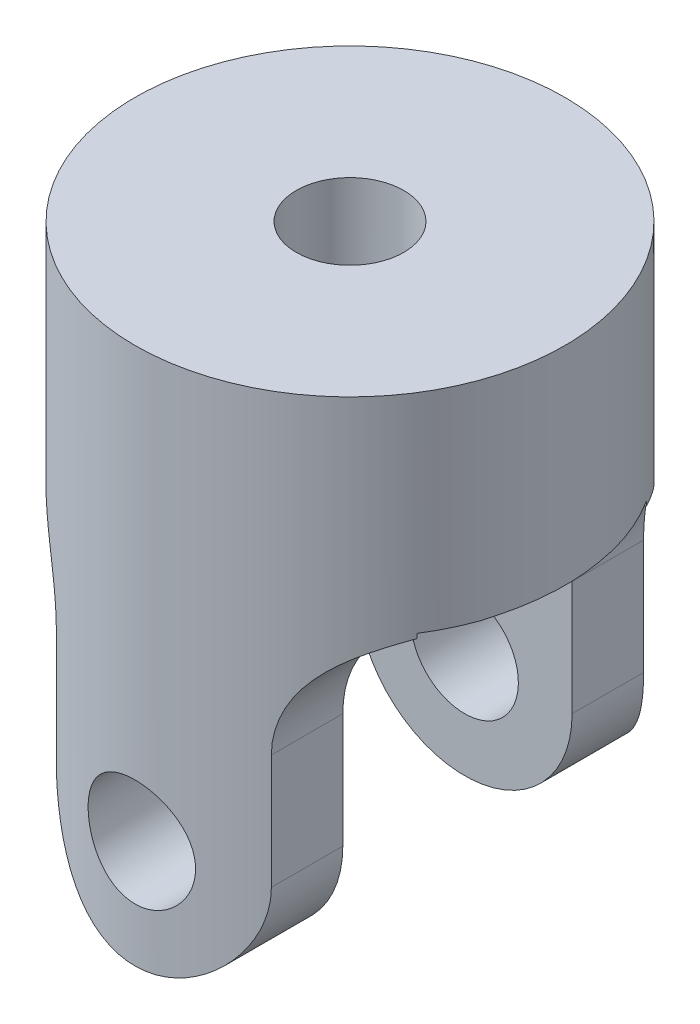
ISO-10303-21;
HEADER;
FILE_DESCRIPTION(('STEP AP214'),'2;1');
FILE_NAME('part.step','',(''),(''),'','','');
FILE_SCHEMA(('AUTOMOTIVE_DESIGN { 1 0 10303 214 1 1 1 1 }'));
ENDSEC;
DATA;
#1=APPLICATION_CONTEXT('core data for automotive mechanical design processes');
#2=APPLICATION_PROTOCOL_DEFINITION('international standard','automotive_design',2000,#1);
#3=PRODUCT_CONTEXT('',#1,'mechanical');
#4=PRODUCT('Part','Part','',(#3));
#5=PRODUCT_RELATED_PRODUCT_CATEGORY('part','',(#4));
#6=PRODUCT_DEFINITION_FORMATION('','',#4);
#7=PRODUCT_DEFINITION_CONTEXT('part definition',#1,'design');
#8=PRODUCT_DEFINITION('design','',#6,#7);
#9=PRODUCT_DEFINITION_SHAPE('','',#8);
#10=(LENGTH_UNIT() NAMED_UNIT(*) SI_UNIT(.MILLI.,.METRE.));
#11=(NAMED_UNIT(*) PLANE_ANGLE_UNIT() SI_UNIT($,.RADIAN.));
#12=(NAMED_UNIT(*) SI_UNIT($,.STERADIAN.) SOLID_ANGLE_UNIT());
#13=UNCERTAINTY_MEASURE_WITH_UNIT(LENGTH_MEASURE(1.E-05),#10,'distance_accuracy_value','');
#14=(GEOMETRIC_REPRESENTATION_CONTEXT(3) GLOBAL_UNCERTAINTY_ASSIGNED_CONTEXT((#13)) GLOBAL_UNIT_ASSIGNED_CONTEXT((#10,
#11,#12)) REPRESENTATION_CONTEXT('',''));
#15=CARTESIAN_POINT('',(0.,0.,0.));
#16=DIRECTION('',(0.,0.,1.));
#17=DIRECTION('',(1.,0.,0.));
#18=AXIS2_PLACEMENT_3D('',#15,#16,#17);
#19=CARTESIAN_POINT('',(0.,47.625,0.));
#20=DIRECTION('',(0.,-1.,0.));
#21=DIRECTION('',(0.,0.,-1.));
#22=AXIS2_PLACEMENT_3D('',#19,#20,#21);
#23=CYLINDRICAL_SURFACE('',#22,19.05);
#24=CARTESIAN_POINT('',(0.,14.2875,-19.05));
#25=CARTESIAN_POINT('',(-0.263131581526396,14.2874926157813,-19.0499955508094));
#26=CARTESIAN_POINT('',(-0.526345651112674,14.2656193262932,-19.0444938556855));
#27=CARTESIAN_POINT('',(-1.04523007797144,14.1788351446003,-19.0230796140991));
#28=CARTESIAN_POINT('',(-1.3008960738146,14.1138998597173,-19.0071611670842));
#29=CARTESIAN_POINT('',(-1.79711626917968,13.9432053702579,-18.966676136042));
#30=CARTESIAN_POINT('',(-2.03768821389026,13.837495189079,-18.9421199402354));
#31=CARTESIAN_POINT('',(-2.49768401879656,13.5884240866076,-18.886974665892));
#32=CARTESIAN_POINT('',(-2.71710716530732,13.4450618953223,-18.8563853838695));
#33=CARTESIAN_POINT('',(-3.1330961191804,13.121637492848,-18.7917903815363));
#34=CARTESIAN_POINT('',(-3.32916431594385,12.940945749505,-18.757731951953));
#35=CARTESIAN_POINT('',(-3.68855284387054,12.5493392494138,-18.6903874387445));
#36=CARTESIAN_POINT('',(-3.85186947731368,12.3384210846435,-18.6571014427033));
#37=CARTESIAN_POINT('',(-4.14345927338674,11.8884851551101,-18.5945391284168));
#38=CARTESIAN_POINT('',(-4.27117578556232,11.6490964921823,-18.5653297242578));
#39=CARTESIAN_POINT('',(-4.48436018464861,11.1513987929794,-18.514996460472));
#40=CARTESIAN_POINT('',(-4.56983482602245,10.8930927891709,-18.4938713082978));
#41=CARTESIAN_POINT('',(-4.69441160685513,10.3703643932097,-18.4626401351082));
#42=CARTESIAN_POINT('',(-4.73440845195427,10.1061682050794,-18.4523218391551));
#43=CARTESIAN_POINT('',(-4.76968113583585,9.57462979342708,-18.443237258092));
#44=CARTESIAN_POINT('',(-4.7649642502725,9.30728808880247,-18.4444690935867));
#45=CARTESIAN_POINT('',(-4.71165721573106,8.78390481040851,-18.4581547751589));
#46=CARTESIAN_POINT('',(-4.66413323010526,8.52774640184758,-18.4703359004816));
#47=CARTESIAN_POINT('',(-4.528261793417,8.02715866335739,-18.5041130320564));
#48=CARTESIAN_POINT('',(-4.43991143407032,7.78273017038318,-18.5257097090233));
#49=CARTESIAN_POINT('',(-4.22398659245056,7.30968179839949,-18.5761348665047));
#50=CARTESIAN_POINT('',(-4.09602516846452,7.08124640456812,-18.6050341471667));
#51=CARTESIAN_POINT('',(-3.80478117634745,6.6487080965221,-18.6667683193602));
#52=CARTESIAN_POINT('',(-3.64149242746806,6.44460944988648,-18.6996038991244));
#53=CARTESIAN_POINT('',(-3.27870637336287,6.06042852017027,-18.7666592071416));
#54=CARTESIAN_POINT('',(-3.07830936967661,5.88119699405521,-18.8008917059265));
#55=CARTESIAN_POINT('',(-2.64989283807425,5.55872255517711,-18.8660394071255));
#56=CARTESIAN_POINT('',(-2.42187246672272,5.41548074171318,-18.8969545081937));
#57=CARTESIAN_POINT('',(-1.94346794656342,5.16873938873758,-18.9521379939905));
#58=CARTESIAN_POINT('',(-1.69300967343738,5.06537804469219,-18.9763831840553));
#59=CARTESIAN_POINT('',(-1.17753132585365,4.90246255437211,-19.0153263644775));
#60=CARTESIAN_POINT('',(-0.912514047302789,4.84290002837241,-19.0300261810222));
#61=CARTESIAN_POINT('',(-0.382714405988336,4.77057222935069,-19.0479521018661));
#62=CARTESIAN_POINT('',(-0.118099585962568,4.75664839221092,-19.0514621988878));
#63=CARTESIAN_POINT('',(0.409679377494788,4.77281558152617,-19.0474220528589));
#64=CARTESIAN_POINT('',(0.672843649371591,4.80290264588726,-19.0398728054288));
#65=CARTESIAN_POINT('',(1.18622530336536,4.90528263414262,-19.0147442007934));
#66=CARTESIAN_POINT('',(1.43657675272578,4.97694351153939,-18.9973151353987));
#67=CARTESIAN_POINT('',(1.92169190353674,5.15971499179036,-18.9543914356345));
#68=CARTESIAN_POINT('',(2.15645402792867,5.27082957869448,-18.928895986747));
#69=CARTESIAN_POINT('',(2.60833595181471,5.5315997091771,-18.8719875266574));
#70=CARTESIAN_POINT('',(2.82506877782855,5.6819041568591,-18.8404775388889));
#71=CARTESIAN_POINT('',(3.23064699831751,6.015957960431,-18.7751881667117));
#72=CARTESIAN_POINT('',(3.41948756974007,6.19971308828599,-18.7414083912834));
#73=CARTESIAN_POINT('',(3.76869505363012,6.60083122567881,-18.6743643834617));
#74=CARTESIAN_POINT('',(3.92824927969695,6.81890845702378,-18.6411331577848));
#75=CARTESIAN_POINT('',(4.20849665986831,7.27942611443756,-18.5798738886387));
#76=CARTESIAN_POINT('',(4.32919153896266,7.5218654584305,-18.5518456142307));
#77=CARTESIAN_POINT('',(4.5273957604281,8.02292566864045,-18.5044745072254));
#78=CARTESIAN_POINT('',(4.60516095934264,8.28144021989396,-18.4850803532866));
#79=CARTESIAN_POINT('',(4.71597247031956,8.80843310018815,-18.457124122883));
#80=CARTESIAN_POINT('',(4.7490285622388,9.0769092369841,-18.4485596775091));
#81=CARTESIAN_POINT('',(4.76897252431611,9.6079342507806,-18.4434131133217));
#82=CARTESIAN_POINT('',(4.75715932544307,9.87043185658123,-18.4464938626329));
#83=CARTESIAN_POINT('',(4.69067285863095,10.3895648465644,-18.4635111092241));
#84=CARTESIAN_POINT('',(4.63600045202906,10.6462003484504,-18.4774473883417));
#85=CARTESIAN_POINT('',(4.48605693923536,11.1449118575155,-18.5144175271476));
#86=CARTESIAN_POINT('',(4.39102945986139,11.3870654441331,-18.5373967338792));
#87=CARTESIAN_POINT('',(4.1632661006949,11.8521650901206,-18.5898712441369));
#88=CARTESIAN_POINT('',(4.03052499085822,12.0751084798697,-18.6193674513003));
#89=CARTESIAN_POINT('',(3.72703010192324,12.5017359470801,-18.6825138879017));
#90=CARTESIAN_POINT('',(3.5553750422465,12.7047659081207,-18.7162524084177));
#91=CARTESIAN_POINT('',(3.18068125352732,13.0795618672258,-18.7835548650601));
#92=CARTESIAN_POINT('',(2.97763508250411,13.2513204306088,-18.8171187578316));
#93=CARTESIAN_POINT('',(2.54148458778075,13.5617309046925,-18.8810155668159));
#94=CARTESIAN_POINT('',(2.30790249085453,13.6997268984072,-18.911278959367));
#95=CARTESIAN_POINT('',(1.82011973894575,13.9342731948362,-18.9644313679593));
#96=CARTESIAN_POINT('',(1.56593401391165,14.0308531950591,-18.9873256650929));
#97=CARTESIAN_POINT('',(1.09350255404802,14.1654905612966,-19.0197758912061));
#98=CARTESIAN_POINT('',(0.87750704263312,14.2111451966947,-19.031032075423));
#99=CARTESIAN_POINT('',(0.441026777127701,14.2721518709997,-19.0461457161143));
#100=CARTESIAN_POINT('',(0.220542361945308,14.2875061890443,-19.0500037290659));
#101=CARTESIAN_POINT('',(0.,14.2875,-19.05));
#102=B_SPLINE_CURVE_WITH_KNOTS('',3,(#24,#25,#26,#27,#28,#29,#30,#31,#32,#33,#34,#35,#36,#37,
#38,#39,#40,#41,#42,#43,#44,#45,#46,#47,#48,#49,#50,#51,#52,#53,#54,#55,#56,#57,#58,#59,#60,#61,
#62,#63,#64,#65,#66,#67,#68,#69,#70,#71,#72,#73,#74,#75,#76,#77,#78,#79,#80,#81,#82,#83,#84,#85,
#86,#87,#88,#89,#90,#91,#92,#93,#94,#95,#96,#97,#98,#99,#100,#101),.UNSPECIFIED.,.T.,.F.,(4,2,2,
2,2,2,2,2,2,2,2,2,2,2,2,2,2,2,2,2,2,2,2,2,2,2,2,2,2,2,2,2,2,2,2,2,2,2,4),(0.,0.78858653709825,
1.57762015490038,2.36570806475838,3.15382256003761,3.95650832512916,4.75928466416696,
5.57398705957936,6.38855914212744,7.18681236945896,7.98493571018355,8.76371428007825,
9.54254833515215,10.3292442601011,11.1160779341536,11.9253476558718,12.7346420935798,
13.5467162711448,14.3586350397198,15.1497763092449,15.940846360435,16.7201937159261,
17.4996197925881,18.2928764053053,19.08627002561,19.8991381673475,20.7119702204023,
21.5199040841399,22.3276611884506,23.1122150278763,23.8967531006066,24.6766207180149,
25.4565965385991,26.2569190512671,27.0574315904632,27.8724418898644,28.6868668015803,
29.3478662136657,30.008815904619),.UNSPECIFIED.);
#103=CARTESIAN_POINT('',(0.,14.2875,-19.05));
#104=VERTEX_POINT('',#103);
#105=EDGE_CURVE('E151',#104,#104,#102,.T.);
#106=ORIENTED_EDGE('',*,*,#105,.T.);
#107=EDGE_LOOP('',(#106));
#108=FACE_BOUND('',#107,.T.);
#109=CARTESIAN_POINT('',(4.7625,9.525,18.4450831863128));
#110=CARTESIAN_POINT('',(4.7624925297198,9.26201331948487,18.4450882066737));
#111=CARTESIAN_POINT('',(4.74064249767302,8.99894396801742,18.4507690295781));
#112=CARTESIAN_POINT('',(4.65395905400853,8.48035976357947,18.4728204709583));
#113=CARTESIAN_POINT('',(4.58910062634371,8.22484939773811,18.4891973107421));
#114=CARTESIAN_POINT('',(4.41863073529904,7.72895925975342,18.5306727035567));
#115=CARTESIAN_POINT('',(4.31307188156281,7.48856041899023,18.5557599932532));
#116=CARTESIAN_POINT('',(4.06435777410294,7.02885782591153,18.6118155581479));
#117=CARTESIAN_POINT('',(3.92120092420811,6.80955496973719,18.6427840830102));
#118=CARTESIAN_POINT('',(3.59798955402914,6.39344356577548,18.7078756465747));
#119=CARTESIAN_POINT('',(3.41725927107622,6.19716769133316,18.7420490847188));
#120=CARTESIAN_POINT('',(3.02548683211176,5.83737454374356,18.8092627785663));
#121=CARTESIAN_POINT('',(2.81444184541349,5.67386033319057,18.8423029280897));
#122=CARTESIAN_POINT('',(2.36438160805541,5.38205273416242,18.9040849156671));
#123=CARTESIAN_POINT('',(2.12501716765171,5.25428263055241,18.9327603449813));
#124=CARTESIAN_POINT('',(1.62737136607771,5.04099262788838,18.98200696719));
#125=CARTESIAN_POINT('',(1.36909280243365,4.95546649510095,19.0025793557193));
#126=CARTESIAN_POINT('',(0.846503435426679,4.8307983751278,19.0329456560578));
#127=CARTESIAN_POINT('',(0.582420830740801,4.79075182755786,19.0429494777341));
#128=CARTESIAN_POINT('',(0.0511089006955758,4.75534028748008,19.0517829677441));
#129=CARTESIAN_POINT('',(-0.216119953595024,4.75996868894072,19.0506142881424));
#130=CARTESIAN_POINT('',(-0.739865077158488,4.81312508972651,19.0373907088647));
#131=CARTESIAN_POINT('',(-0.996487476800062,4.86067669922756,19.0255779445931));
#132=CARTESIAN_POINT('',(-1.4979884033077,4.99676026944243,18.992675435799));
#133=CARTESIAN_POINT('',(-1.74286630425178,5.08529441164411,18.9715851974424));
#134=CARTESIAN_POINT('',(-2.21649942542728,5.30161989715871,18.9221270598));
#135=CARTESIAN_POINT('',(-2.44508897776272,5.42975872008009,18.8936951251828));
#136=CARTESIAN_POINT('',(-2.87786265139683,5.72139256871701,18.8326376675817));
#137=CARTESIAN_POINT('',(-3.08204251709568,5.88489374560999,18.8000114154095));
#138=CARTESIAN_POINT('',(-3.46602384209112,6.24784515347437,18.733078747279));
#139=CARTESIAN_POINT('',(-3.6450159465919,6.44814856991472,18.6987507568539));
#140=CARTESIAN_POINT('',(-3.96704999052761,6.87628794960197,18.6330915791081));
#141=CARTESIAN_POINT('',(-4.11009024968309,7.10412519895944,18.6017605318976));
#142=CARTESIAN_POINT('',(-4.35667846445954,7.58245251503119,18.5455654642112));
#143=CARTESIAN_POINT('',(-4.46003156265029,7.8330470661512,18.5207335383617));
#144=CARTESIAN_POINT('',(-4.6228902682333,8.34882531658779,18.4807600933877));
#145=CARTESIAN_POINT('',(-4.68240525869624,8.61400588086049,18.4656165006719));
#146=CARTESIAN_POINT('',(-4.75455546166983,9.14392285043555,18.4471695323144));
#147=CARTESIAN_POINT('',(-4.76838735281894,9.40848599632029,18.4435639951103));
#148=CARTESIAN_POINT('',(-4.75205486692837,9.93614078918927,18.4477788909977));
#149=CARTESIAN_POINT('',(-4.72189453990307,10.1992325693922,18.4555982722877));
#150=CARTESIAN_POINT('',(-4.61948300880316,10.7120326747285,18.4814924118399));
#151=CARTESIAN_POINT('',(-4.54792855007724,10.9618895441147,18.4993972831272));
#152=CARTESIAN_POINT('',(-4.36553244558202,11.4460619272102,18.5432836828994));
#153=CARTESIAN_POINT('',(-4.25468614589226,11.6803755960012,18.5692661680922));
#154=CARTESIAN_POINT('',(-3.99434812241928,12.1318806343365,18.6270164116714));
#155=CARTESIAN_POINT('',(-3.84414094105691,12.3486459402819,18.6588876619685));
#156=CARTESIAN_POINT('',(-3.51024964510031,12.7543338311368,18.7245704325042));
#157=CARTESIAN_POINT('',(-3.32656002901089,12.9432518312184,18.7583822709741));
#158=CARTESIAN_POINT('',(-2.92542620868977,13.2927300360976,18.8251605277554));
#159=CARTESIAN_POINT('',(-2.70725242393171,13.4524624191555,18.8580846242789));
#160=CARTESIAN_POINT('',(-2.24648402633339,13.7330228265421,18.9185019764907));
#161=CARTESIAN_POINT('',(-2.00389068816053,13.8538528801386,18.9459955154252));
#162=CARTESIAN_POINT('',(-1.50284593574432,14.0521296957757,18.9922807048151));
#163=CARTESIAN_POINT('',(-1.24452402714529,14.1298884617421,19.0111347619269));
#164=CARTESIAN_POINT('',(-0.717945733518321,14.240751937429,19.0382898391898));
#165=CARTESIAN_POINT('',(-0.449691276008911,14.2738652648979,19.0465928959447));
#166=CARTESIAN_POINT('',(0.0813602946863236,14.2940131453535,19.0516273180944));
#167=CARTESIAN_POINT('',(0.344108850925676,14.2822693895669,19.0486654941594));
#168=CARTESIAN_POINT('',(0.863762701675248,14.2158347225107,19.0321833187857));
#169=CARTESIAN_POINT('',(1.12066816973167,14.1611450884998,19.0186632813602));
#170=CARTESIAN_POINT('',(1.62006455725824,14.0110263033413,18.9826312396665));
#171=CARTESIAN_POINT('',(1.86262563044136,13.9158180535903,18.9601680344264));
#172=CARTESIAN_POINT('',(2.32846746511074,13.6875651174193,18.908615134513));
#173=CARTESIAN_POINT('',(2.55174579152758,13.5545156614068,18.8795246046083));
#174=CARTESIAN_POINT('',(2.97847668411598,13.2506311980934,18.8169827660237));
#175=CARTESIAN_POINT('',(3.18132613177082,13.0789673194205,18.7834436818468));
#176=CARTESIAN_POINT('',(3.55575403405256,12.7043361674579,18.7161796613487));
#177=CARTESIAN_POINT('',(3.72732454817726,12.5013609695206,18.6824546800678));
#178=CARTESIAN_POINT('',(4.0374666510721,12.0653107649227,18.6179210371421));
#179=CARTESIAN_POINT('',(4.1753628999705,11.831744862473,18.5871785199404));
#180=CARTESIAN_POINT('',(4.4097268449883,11.3440107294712,18.5329808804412));
#181=CARTESIAN_POINT('',(4.50622468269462,11.0898576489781,18.5095204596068));
#182=CARTESIAN_POINT('',(4.6406872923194,10.6176269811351,18.4762096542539));
#183=CARTESIAN_POINT('',(4.68626747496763,10.401808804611,18.4646250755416));
#184=CARTESIAN_POINT('',(4.74717566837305,9.96567951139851,18.4490600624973));
#185=CARTESIAN_POINT('',(4.76250625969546,9.74536877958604,18.4450789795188));
#186=CARTESIAN_POINT('',(4.7625,9.525,18.4450831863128));
#187=B_SPLINE_CURVE_WITH_KNOTS('',3,(#109,#110,#111,#112,#113,#114,#115,#116,#117,#118,#119,
#120,#121,#122,#123,#124,#125,#126,#127,#128,#129,#130,#131,#132,#133,#134,#135,#136,#137,#138,
#139,#140,#141,#142,#143,#144,#145,#146,#147,#148,#149,#150,#151,#152,#153,#154,#155,#156,#157,
#158,#159,#160,#161,#162,#163,#164,#165,#166,#167,#168,#169,#170,#171,#172,#173,#174,#175,#176,
#177,#178,#179,#180,#181,#182,#183,#184,#185,#186),.UNSPECIFIED.,.T.,.F.,(4,2,2,2,2,2,2,2,2,2,2,
2,2,2,2,2,2,2,2,2,2,2,2,2,2,2,2,2,2,2,2,2,2,2,2,2,2,2,4),(0.,0.788150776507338,1.57676038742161,
2.36435403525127,3.15198112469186,3.95523632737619,4.75856658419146,5.57310600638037,
6.3875251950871,7.18544570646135,7.98324823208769,8.76334790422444,9.54348910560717,
10.3306792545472,11.1180064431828,11.9266423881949,12.7353161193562,13.5479110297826,
14.3603319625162,15.1512950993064,15.9421854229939,16.7201355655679,17.4981778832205,
18.2914832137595,19.0849190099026,19.8982075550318,20.7114536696,21.5187289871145,
22.3258484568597,23.1111446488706,23.896417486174,24.677462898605,25.4586067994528,
26.258464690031,27.0585253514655,27.8735118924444,28.6879040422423,29.3483886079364,
30.0088168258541),.UNSPECIFIED.);
#188=CARTESIAN_POINT('',(4.7625,9.525,18.4450831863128));
#189=VERTEX_POINT('',#188);
#190=EDGE_CURVE('E241',#189,#189,#187,.T.);
#191=ORIENTED_EDGE('',*,*,#190,.T.);
#192=EDGE_LOOP('',(#191));
#193=FACE_BOUND('',#192,.T.);
#194=CARTESIAN_POINT('',(0.,47.625,0.));
#195=DIRECTION('',(0.,1.,0.));
#196=DIRECTION('',(0.,0.,1.));
#197=AXIS2_PLACEMENT_3D('',#194,#195,#196);
#198=CIRCLE('',#197,19.05);
#199=CARTESIAN_POINT('',(0.,47.625,19.05));
#200=VERTEX_POINT('',#199);
#201=EDGE_CURVE('E289',#200,#200,#198,.T.);
#202=ORIENTED_EDGE('',*,*,#201,.F.);
#203=EDGE_LOOP('',(#202));
#204=FACE_BOUND('',#203,.T.);
#205=CARTESIAN_POINT('',(0.,29.1452388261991,0.));
#206=DIRECTION('',(0.,-1.,0.));
#207=DIRECTION('',(0.,0.,-1.));
#208=AXIS2_PLACEMENT_3D('',#205,#206,#207);
#209=CIRCLE('',#208,19.05);
#210=CARTESIAN_POINT('',(-16.1144934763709,29.1452388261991,10.16));
#211=VERTEX_POINT('',#210);
#212=CARTESIAN_POINT('',(-17.9411689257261,29.1452388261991,6.40444826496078));
#213=VERTEX_POINT('',#212);
#214=EDGE_CURVE('E161',#211,#213,#209,.T.);
#215=ORIENTED_EDGE('',*,*,#214,.F.);
#216=DIRECTION('',(0.,-1.,0.));
#217=VECTOR('',#216,1.);
#218=CARTESIAN_POINT('',(-16.1144934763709,47.625,10.16));
#219=LINE('',#218,#217);
#220=CARTESIAN_POINT('',(-16.1144934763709,28.7463700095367,10.16));
#221=VERTEX_POINT('',#220);
#222=EDGE_CURVE('E159',#211,#221,#219,.T.);
#223=ORIENTED_EDGE('',*,*,#222,.T.);
#224=CARTESIAN_POINT('',(-19.05,29.21,0.));
#225=CARTESIAN_POINT('',(-19.049996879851,29.2100103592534,-0.533382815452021));
#226=CARTESIAN_POINT('',(-19.027578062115,29.2100818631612,-1.06690565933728));
#227=CARTESIAN_POINT('',(-18.9380246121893,29.2094440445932,-2.13043914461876));
#228=CARTESIAN_POINT('',(-18.8708627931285,29.2087342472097,-2.66044745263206));
#229=CARTESIAN_POINT('',(-18.6920678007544,29.2036935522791,-3.71420914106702));
#230=CARTESIAN_POINT('',(-18.580329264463,29.1993540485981,-4.23794465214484));
#231=CARTESIAN_POINT('',(-18.3132283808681,29.1824053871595,-5.27391133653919));
#232=CARTESIAN_POINT('',(-18.1578801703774,29.1697989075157,-5.78614617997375));
#233=CARTESIAN_POINT('',(-17.8379784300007,29.1336698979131,-6.70057379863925));
#234=CARTESIAN_POINT('',(-17.6806127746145,29.11263742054,-7.10539069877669));
#235=CARTESIAN_POINT('',(-17.3389574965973,29.0566565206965,-7.90259710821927));
#236=CARTESIAN_POINT('',(-17.1546670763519,29.0217076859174,-8.29498624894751));
#237=CARTESIAN_POINT('',(-16.761130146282,28.9330965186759,-9.0638357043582));
#238=CARTESIAN_POINT('',(-16.5519382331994,28.8794746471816,-9.44032850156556));
#239=CARTESIAN_POINT('',(-16.1105999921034,28.7480309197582,-10.1751907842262));
#240=CARTESIAN_POINT('',(-15.8784623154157,28.6702181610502,-10.5335670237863));
#241=CARTESIAN_POINT('',(-15.463528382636,28.5109376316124,-11.1298585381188));
#242=CARTESIAN_POINT('',(-15.2854727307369,28.4368014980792,-11.3730490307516));
#243=CARTESIAN_POINT('',(-14.9211708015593,28.2709441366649,-11.8469571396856));
#244=CARTESIAN_POINT('',(-14.7349266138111,28.1792273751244,-12.0776779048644));
#245=CARTESIAN_POINT('',(-14.3566350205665,27.9761989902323,-12.5249854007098));
#246=CARTESIAN_POINT('',(-14.1645929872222,27.8649050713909,-12.7415846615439));
#247=CARTESIAN_POINT('',(-13.7773567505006,27.6208175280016,-13.1593312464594));
#248=CARTESIAN_POINT('',(-13.582163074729,27.4880274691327,-13.3604811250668));
#249=CARTESIAN_POINT('',(-13.2244608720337,27.2235429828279,-13.7138049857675));
#250=CARTESIAN_POINT('',(-13.061916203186,27.0953403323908,-13.8685600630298));
#251=CARTESIAN_POINT('',(-12.7392126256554,26.8225209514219,-14.1655575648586));
#252=CARTESIAN_POINT('',(-12.5790532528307,26.6779074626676,-14.3078024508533));
#253=CARTESIAN_POINT('',(-12.2635124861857,26.3721121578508,-14.5791656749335));
#254=CARTESIAN_POINT('',(-12.1081305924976,26.210932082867,-14.7082853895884));
#255=CARTESIAN_POINT('',(-11.8046267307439,25.8722360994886,-14.952969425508));
#256=CARTESIAN_POINT('',(-11.6565048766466,25.6947199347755,-15.0685335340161));
#257=CARTESIAN_POINT('',(-11.3693565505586,25.3231488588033,-15.2863623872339));
#258=CARTESIAN_POINT('',(-11.2303760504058,25.129020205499,-15.388562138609));
#259=CARTESIAN_POINT('',(-10.9647092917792,24.726025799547,-15.578972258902));
#260=CARTESIAN_POINT('',(-10.8380232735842,24.517159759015,-15.6671823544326));
#261=CARTESIAN_POINT('',(-10.5991808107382,24.0861350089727,-15.8297425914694));
#262=CARTESIAN_POINT('',(-10.4870246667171,23.8639760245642,-15.9040924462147));
#263=CARTESIAN_POINT('',(-10.2792087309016,23.4081145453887,-16.0391940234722));
#264=CARTESIAN_POINT('',(-10.1835477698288,23.1744128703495,-16.099946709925));
#265=CARTESIAN_POINT('',(-10.0176697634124,22.7175915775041,-16.2036271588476));
#266=CARTESIAN_POINT('',(-9.9459860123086,22.4952456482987,-16.2476271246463));
#267=CARTESIAN_POINT('',(-9.81880485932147,22.0441456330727,-16.3248005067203));
#268=CARTESIAN_POINT('',(-9.76330648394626,21.8153919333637,-16.3579745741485));
#269=CARTESIAN_POINT('',(-9.66925566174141,21.3531951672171,-16.413743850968));
#270=CARTESIAN_POINT('',(-9.63070088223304,21.1197527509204,-16.4363405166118));
#271=CARTESIAN_POINT('',(-9.57103843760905,20.6498812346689,-16.4711541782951));
#272=CARTESIAN_POINT('',(-9.54993079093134,20.4134521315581,-16.4833711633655));
#273=CARTESIAN_POINT('',(-9.52570969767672,19.9446128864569,-16.4973798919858));
#274=CARTESIAN_POINT('',(-9.52220909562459,19.7122293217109,-16.4993959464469));
#275=CARTESIAN_POINT('',(-9.53219956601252,19.2479529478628,-16.4936262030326));
#276=CARTESIAN_POINT('',(-9.54569028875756,19.0160601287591,-16.4858406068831));
#277=CARTESIAN_POINT('',(-9.58949302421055,18.554432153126,-16.4603998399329));
#278=CARTESIAN_POINT('',(-9.6198038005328,18.3246968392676,-16.4427453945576));
#279=CARTESIAN_POINT('',(-9.69686292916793,17.8690016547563,-16.3974188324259));
#280=CARTESIAN_POINT('',(-9.74361132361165,17.6430417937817,-16.3697466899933));
#281=CARTESIAN_POINT('',(-9.85288207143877,17.196754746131,-16.3042100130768));
#282=CARTESIAN_POINT('',(-9.91538653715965,16.9764214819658,-16.2663570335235));
#283=CARTESIAN_POINT('',(-10.0553731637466,16.5426686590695,-16.180195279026));
#284=CARTESIAN_POINT('',(-10.1328552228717,16.3292490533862,-16.1318865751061));
#285=CARTESIAN_POINT('',(-10.3017409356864,15.910813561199,-16.0245634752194));
#286=CARTESIAN_POINT('',(-10.3931426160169,15.7057964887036,-15.9655505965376));
#287=CARTESIAN_POINT('',(-10.5886157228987,15.3054773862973,-15.8365848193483));
#288=CARTESIAN_POINT('',(-10.6926871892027,15.110175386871,-15.7666318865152));
#289=CARTESIAN_POINT('',(-10.9127809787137,14.7291938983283,-15.6151103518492));
#290=CARTESIAN_POINT('',(-11.0288790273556,14.5435880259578,-15.5334667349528));
#291=CARTESIAN_POINT('',(-11.2707794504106,14.1844334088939,-15.3588499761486));
#292=CARTESIAN_POINT('',(-11.3965817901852,14.0108846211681,-15.2658768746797));
#293=CARTESIAN_POINT('',(-11.6561087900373,13.6766079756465,-15.0686489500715));
#294=CARTESIAN_POINT('',(-11.7898334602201,13.5158801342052,-14.9643941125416));
#295=CARTESIAN_POINT('',(-12.0633573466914,13.2077398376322,-14.7447844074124));
#296=CARTESIAN_POINT('',(-12.2031567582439,13.0603278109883,-14.6294291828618));
#297=CARTESIAN_POINT('',(-12.4937638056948,12.772314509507,-14.3821580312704));
#298=CARTESIAN_POINT('',(-12.644778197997,12.6323757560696,-14.2497140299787));
#299=CARTESIAN_POINT('',(-12.9493736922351,12.3672984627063,-13.9734925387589));
#300=CARTESIAN_POINT('',(-13.1029548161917,12.242160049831,-13.8297149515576));
#301=CARTESIAN_POINT('',(-13.4107980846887,12.0062865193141,-13.5314054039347));
#302=CARTESIAN_POINT('',(-13.5650603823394,11.8955548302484,-13.3768708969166));
#303=CARTESIAN_POINT('',(-13.8725108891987,11.6878966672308,-13.0577594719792));
#304=CARTESIAN_POINT('',(-14.0256988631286,11.5909731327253,-12.8931804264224));
#305=CARTESIAN_POINT('',(-14.39837780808,11.3691080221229,-12.4779134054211));
#306=CARTESIAN_POINT('',(-14.6164221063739,11.2514021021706,-12.2220315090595));
#307=CARTESIAN_POINT('',(-15.0430905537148,11.0405220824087,-11.6928866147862));
#308=CARTESIAN_POINT('',(-15.251711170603,10.947357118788,-11.4196171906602));
#309=CARTESIAN_POINT('',(-15.6569663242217,10.7821388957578,-10.8573587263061));
#310=CARTESIAN_POINT('',(-15.8535749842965,10.7101300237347,-10.5683381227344));
#311=CARTESIAN_POINT('',(-16.2321389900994,10.5841718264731,-9.97714699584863));
#312=CARTESIAN_POINT('',(-16.4140939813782,10.5302229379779,-9.67497615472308));
#313=CARTESIAN_POINT('',(-16.8245793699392,10.4203775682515,-8.94804188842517));
#314=CARTESIAN_POINT('',(-17.0462056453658,10.3708109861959,-8.51840770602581));
#315=CARTESIAN_POINT('',(-17.4567300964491,10.2918741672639,-7.64195817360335));
#316=CARTESIAN_POINT('',(-17.645616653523,10.2625110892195,-7.19513679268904));
#317=CARTESIAN_POINT('',(-17.9889969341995,10.2176935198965,-6.28760456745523));
#318=CARTESIAN_POINT('',(-18.1434753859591,10.20224519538,-5.82688765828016));
#319=CARTESIAN_POINT('',(-18.4167998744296,10.1800812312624,-4.89487865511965));
#320=CARTESIAN_POINT('',(-18.5356492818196,10.1733647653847,-4.42358756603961));
#321=CARTESIAN_POINT('',(-18.7390770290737,10.164519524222,-3.46341943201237));
#322=CARTESIAN_POINT('',(-18.8228945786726,10.1624886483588,-2.9743803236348));
#323=CARTESIAN_POINT('',(-18.9521307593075,10.1602834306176,-1.99124760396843));
#324=CARTESIAN_POINT('',(-18.9975487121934,10.1601091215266,-1.49715390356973));
#325=CARTESIAN_POINT('',(-19.0497076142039,10.1599638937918,-0.506913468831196));
#326=CARTESIAN_POINT('',(-19.056447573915,10.159992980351,-0.0107666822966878));
#327=CARTESIAN_POINT('',(-19.0312083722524,10.1600110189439,0.98054218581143));
#328=CARTESIAN_POINT('',(-18.9992283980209,10.159999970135,1.47570424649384));
#329=CARTESIAN_POINT('',(-18.8926312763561,10.1611364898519,2.50154876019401));
#330=CARTESIAN_POINT('',(-18.8148050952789,10.1623769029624,3.03190062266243));
#331=CARTESIAN_POINT('',(-18.6147375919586,10.1694249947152,4.08423134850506));
#332=CARTESIAN_POINT('',(-18.4924884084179,10.1752334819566,4.60620871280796));
#333=CARTESIAN_POINT('',(-18.2045264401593,10.1964999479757,5.63777006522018));
#334=CARTESIAN_POINT('',(-18.0388201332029,10.2119564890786,6.14735588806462));
#335=CARTESIAN_POINT('',(-17.665376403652,10.2592968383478,7.15002542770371));
#336=CARTESIAN_POINT('',(-17.4576550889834,10.2911743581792,7.64311538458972));
#337=CARTESIAN_POINT('',(-17.0684462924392,10.3669485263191,8.46843599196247));
#338=CARTESIAN_POINT('',(-16.8967847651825,10.4046902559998,8.80589420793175));
#339=CARTESIAN_POINT('',(-16.5346560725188,10.4962259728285,9.46837085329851));
#340=CARTESIAN_POINT('',(-16.3441901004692,10.550018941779,9.79339007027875));
#341=CARTESIAN_POINT('',(-15.9465991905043,10.6773359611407,10.428254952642));
#342=CARTESIAN_POINT('',(-15.739505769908,10.7508232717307,10.7381276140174));
#343=CARTESIAN_POINT('',(-15.3108822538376,10.9215647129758,11.3408987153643));
#344=CARTESIAN_POINT('',(-15.0893560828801,11.0188124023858,11.6338017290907));
#345=CARTESIAN_POINT('',(-14.6895799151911,11.2145005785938,12.1324012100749));
#346=CARTESIAN_POINT('',(-14.5136187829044,11.3071178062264,12.342227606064));
#347=CARTESIAN_POINT('',(-14.157392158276,11.5100375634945,12.7492675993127));
#348=CARTESIAN_POINT('',(-13.9771277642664,11.6203356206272,12.9464843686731));
#349=CARTESIAN_POINT('',(-13.614703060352,11.8600174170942,13.3270930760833));
#350=CARTESIAN_POINT('',(-13.4325430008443,11.9893986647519,13.5104868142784));
#351=CARTESIAN_POINT('',(-13.0691389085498,12.2683044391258,13.8623255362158));
#352=CARTESIAN_POINT('',(-12.8878948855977,12.4178291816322,14.0307703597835));
#353=CARTESIAN_POINT('',(-12.5278873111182,12.7390387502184,14.3531691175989));
#354=CARTESIAN_POINT('',(-12.3491614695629,12.9109132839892,14.5069768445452));
#355=CARTESIAN_POINT('',(-11.9994369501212,13.2757087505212,14.7975578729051));
#356=CARTESIAN_POINT('',(-11.8284384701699,13.4686302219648,14.9343307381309));
#357=CARTESIAN_POINT('',(-11.4978748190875,13.8747043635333,15.1902955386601));
#358=CARTESIAN_POINT('',(-11.3383044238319,14.0878476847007,15.309495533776));
#359=CARTESIAN_POINT('',(-11.0340362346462,14.5330485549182,15.5302251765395));
#360=CARTESIAN_POINT('',(-10.8893360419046,14.7651030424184,15.6317576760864));
#361=CARTESIAN_POINT('',(-10.6375938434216,15.2114194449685,15.8039202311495));
#362=CARTESIAN_POINT('',(-10.5281305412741,15.4234197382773,15.8768952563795));
#363=CARTESIAN_POINT('',(-10.3241959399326,15.8583011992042,16.0102570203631));
#364=CARTESIAN_POINT('',(-10.2297230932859,16.0811812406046,16.0706450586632));
#365=CARTESIAN_POINT('',(-10.0572751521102,16.5360809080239,16.179125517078));
#366=CARTESIAN_POINT('',(-9.97929736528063,16.7680990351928,16.2272199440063));
#367=CARTESIAN_POINT('',(-9.84102162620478,17.239461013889,16.311448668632));
#368=CARTESIAN_POINT('',(-9.78072332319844,17.4788047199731,16.3475832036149));
#369=CARTESIAN_POINT('',(-9.68188771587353,17.9477871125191,16.4062987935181));
#370=CARTESIAN_POINT('',(-9.64222956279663,18.1771026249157,16.4295834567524));
#371=CARTESIAN_POINT('',(-9.5797648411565,18.6388017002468,16.46608390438));
#372=CARTESIAN_POINT('',(-9.55695739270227,18.8711851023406,16.4793002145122));
#373=CARTESIAN_POINT('',(-9.52848426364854,19.3373197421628,16.4957800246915));
#374=CARTESIAN_POINT('',(-9.52281640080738,19.5710708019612,16.4990447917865));
#375=CARTESIAN_POINT('',(-9.52868739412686,20.0382873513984,16.4956548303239));
#376=CARTESIAN_POINT('',(-9.54022638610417,20.2717528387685,16.4890000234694));
#377=CARTESIAN_POINT('',(-9.58021982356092,20.7350247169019,16.4657953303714));
#378=CARTESIAN_POINT('',(-9.60855109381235,20.9648453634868,16.4493174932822));
#379=CARTESIAN_POINT('',(-9.68167117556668,21.4209069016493,16.4063871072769));
#380=CARTESIAN_POINT('',(-9.72645981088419,21.6471478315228,16.3799346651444));
#381=CARTESIAN_POINT('',(-9.83191636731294,22.0944292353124,16.316852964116));
#382=CARTESIAN_POINT('',(-9.89258292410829,22.3154701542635,16.2802245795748));
#383=CARTESIAN_POINT('',(-10.0290018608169,22.7508198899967,16.1965434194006));
#384=CARTESIAN_POINT('',(-10.1047542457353,22.9651287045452,16.1494906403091));
#385=CARTESIAN_POINT('',(-10.2704188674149,23.3857746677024,16.0446442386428));
#386=CARTESIAN_POINT('',(-10.3603467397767,23.5921026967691,15.9868387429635));
#387=CARTESIAN_POINT('',(-10.5530613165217,23.9951691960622,15.8602861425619));
#388=CARTESIAN_POINT('',(-10.6558479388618,24.1919077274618,15.7915391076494));
#389=CARTESIAN_POINT('',(-10.8728256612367,24.5745618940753,15.6429358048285));
#390=CARTESIAN_POINT('',(-10.987015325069,24.7604788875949,15.5630809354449));
#391=CARTESIAN_POINT('',(-11.225197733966,25.1205023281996,15.392170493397));
#392=CARTESIAN_POINT('',(-11.3491905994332,25.2946086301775,15.3011147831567));
#393=CARTESIAN_POINT('',(-11.6077455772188,25.6335112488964,15.1059418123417));
#394=CARTESIAN_POINT('',(-11.7424670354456,25.7980587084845,15.0016038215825));
#395=CARTESIAN_POINT('',(-12.0183672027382,26.1135051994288,14.7814913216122));
#396=CARTESIAN_POINT('',(-12.1595459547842,26.26440413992,14.6657167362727));
#397=CARTESIAN_POINT('',(-12.4464439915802,26.5523126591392,14.4230312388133));
#398=CARTESIAN_POINT('',(-12.5921638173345,26.689320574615,14.2961189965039));
#399=CARTESIAN_POINT('',(-12.8862640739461,26.94947115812,14.0316008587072));
#400=CARTESIAN_POINT('',(-13.0346448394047,27.0726120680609,13.8939936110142));
#401=CARTESIAN_POINT('',(-13.3452197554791,27.3154169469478,13.5962421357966));
#402=CARTESIAN_POINT('',(-13.5074942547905,27.433849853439,13.4351785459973));
#403=CARTESIAN_POINT('',(-13.8310228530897,27.6553417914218,13.1018801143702));
#404=CARTESIAN_POINT('',(-13.9922769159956,27.7584002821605,12.9296448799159));
#405=CARTESIAN_POINT('',(-14.3120094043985,27.9500970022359,12.5748130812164));
#406=CARTESIAN_POINT('',(-14.470487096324,28.038731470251,12.3922138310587));
#407=CARTESIAN_POINT('',(-14.783117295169,28.20265806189,12.0175512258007));
#408=CARTESIAN_POINT('',(-14.937268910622,28.2779474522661,11.8254859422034));
#409=CARTESIAN_POINT('',(-15.326265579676,28.4558463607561,11.3207512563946));
#410=CARTESIAN_POINT('',(-15.557013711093,28.5495617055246,11.001748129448));
#411=CARTESIAN_POINT('',(-16.0008943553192,28.7118757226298,10.3455804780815));
#412=CARTESIAN_POINT('',(-16.2140186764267,28.7804627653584,10.0084076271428));
#413=CARTESIAN_POINT('',(-16.6205587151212,28.8973996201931,9.31775414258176));
#414=CARTESIAN_POINT('',(-16.8139169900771,28.9456916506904,8.96423008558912));
#415=CARTESIAN_POINT('',(-17.1784152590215,29.0261782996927,8.24423725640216));
#416=CARTESIAN_POINT('',(-17.3495560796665,29.0583735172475,7.87776896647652));
#417=CARTESIAN_POINT('',(-17.7139507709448,29.1181250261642,7.02772612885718));
#418=CARTESIAN_POINT('',(-17.8995689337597,29.1417328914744,6.5405877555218));
#419=CARTESIAN_POINT('',(-18.2303913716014,29.1761282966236,5.55221872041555));
#420=CARTESIAN_POINT('',(-18.3755800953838,29.1869109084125,5.05098271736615));
#421=CARTESIAN_POINT('',(-18.6240927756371,29.2012851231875,4.03935328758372));
#422=CARTESIAN_POINT('',(-18.7275094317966,29.2048927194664,3.5289827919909));
#423=CARTESIAN_POINT('',(-18.8921736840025,29.2090510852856,2.50172549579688));
#424=CARTESIAN_POINT('',(-18.9534464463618,29.209603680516,1.98484277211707));
#425=CARTESIAN_POINT('',(-19.0123093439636,29.2099398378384,1.22250024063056));
#426=CARTESIAN_POINT('',(-19.0264404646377,29.2099756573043,0.978218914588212));
#427=CARTESIAN_POINT('',(-19.045286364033,29.2100033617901,0.489301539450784));
#428=CARTESIAN_POINT('',(-19.0500014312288,29.209995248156,0.244665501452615));
#429=CARTESIAN_POINT('',(-19.05,29.21,0.));
#430=B_SPLINE_CURVE_WITH_KNOTS('',3,(#224,#225,#226,#227,#228,#229,#230,#231,#232,#233,#234,
#235,#236,#237,#238,#239,#240,#241,#242,#243,#244,#245,#246,#247,#248,#249,#250,#251,#252,#253,
#254,#255,#256,#257,#258,#259,#260,#261,#262,#263,#264,#265,#266,#267,#268,#269,#270,#271,#272,
#273,#274,#275,#276,#277,#278,#279,#280,#281,#282,#283,#284,#285,#286,#287,#288,#289,#290,#291,
#292,#293,#294,#295,#296,#297,#298,#299,#300,#301,#302,#303,#304,#305,#306,#307,#308,#309,#310,
#311,#312,#313,#314,#315,#316,#317,#318,#319,#320,#321,#322,#323,#324,#325,#326,#327,#328,#329,
#330,#331,#332,#333,#334,#335,#336,#337,#338,#339,#340,#341,#342,#343,#344,#345,#346,#347,#348,
#349,#350,#351,#352,#353,#354,#355,#356,#357,#358,#359,#360,#361,#362,#363,#364,#365,#366,#367,
#368,#369,#370,#371,#372,#373,#374,#375,#376,#377,#378,#379,#380,#381,#382,#383,#384,#385,#386,
#387,#388,#389,#390,#391,#392,#393,#394,#395,#396,#397,#398,#399,#400,#401,#402,#403,#404,#405,
#406,#407,#408,#409,#410,#411,#412,#413,#414,#415,#416,#417,#418,#419,#420,#421,#422,#423,#424,
#425,#426,#427,#428,#429),.UNSPECIFIED.,.T.,.F.,(4,2,2,2,2,2,2,2,2,2,2,2,2,2,2,2,2,2,2,2,2,2,2,
2,2,2,2,2,2,2,2,2,2,2,2,2,2,2,2,2,2,2,2,2,2,2,2,2,2,2,2,2,2,2,2,2,2,2,2,2,2,2,2,2,2,2,2,2,2,2,2,
2,2,2,2,2,2,2,2,2,2,2,2,2,2,2,2,2,2,2,2,2,2,2,2,2,2,2,2,2,2,2,4),(0.,1.59992202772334,
3.2008170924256,4.80551871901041,6.4097007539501,7.71308875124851,9.01651536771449,
10.3171350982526,11.6172663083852,12.5476837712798,13.4778651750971,14.4072096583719,
15.3364001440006,16.1110321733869,16.8855114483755,17.6599094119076,18.4343195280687,
19.2123657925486,19.9904272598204,20.7685048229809,21.5465272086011,22.2588286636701,
22.9710872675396,23.683247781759,24.3954090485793,25.0918401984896,25.7882570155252,
26.4846226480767,27.1809900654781,27.8765704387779,28.5721460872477,29.2676232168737,
29.9631025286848,30.6632630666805,31.3634211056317,32.0635800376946,32.7637614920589,
33.4974167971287,34.2310783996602,34.9649142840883,35.6989061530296,36.7658653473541,
37.8332211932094,38.9028007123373,39.9724060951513,41.4282057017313,42.8845208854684,
44.3414811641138,45.7983035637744,47.2852990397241,48.7723207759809,50.2593805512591,
51.7464715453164,53.3526380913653,54.9590890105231,56.5653006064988,58.1708975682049,
59.311478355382,60.4519868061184,61.5903822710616,62.7284694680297,63.5949528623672,
64.4612174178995,65.3273689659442,66.1935297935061,67.0675919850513,67.9416765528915,
68.8153589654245,69.6889002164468,70.436440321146,71.1839032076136,71.9312439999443,
72.6785699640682,73.3793808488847,74.0801551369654,74.7808401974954,75.4815307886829,
76.1771441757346,76.8727501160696,77.5682963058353,78.2638427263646,78.9601617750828,
79.6564763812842,80.3527033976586,81.0489389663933,81.7587990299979,82.4686638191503,
83.1786135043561,83.8886530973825,84.6603667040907,85.4321074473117,86.2040491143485,
86.9761487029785,88.1884126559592,89.4012369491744,90.6174912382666,91.8337002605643,
93.397124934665,94.9611501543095,96.5216851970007,98.0812875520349,98.8152026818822,
99.5490953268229),.UNSPECIFIED.);
#431=CARTESIAN_POINT('',(-9.525,19.685,16.4977839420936));
#432=VERTEX_POINT('',#431);
#433=EDGE_CURVE('E282',#432,#221,#430,.T.);
#434=ORIENTED_EDGE('',*,*,#433,.F.);
#435=DIRECTION('',(0.,-1.,0.));
#436=VECTOR('',#435,1.);
#437=CARTESIAN_POINT('',(-9.52499999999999,47.625,16.4977839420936));
#438=LINE('',#437,#436);
#439=CARTESIAN_POINT('',(-9.525,9.525,16.4977839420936));
#440=VERTEX_POINT('',#439);
#441=EDGE_CURVE('E286',#440,#432,#438,.F.);
#442=ORIENTED_EDGE('',*,*,#441,.F.);
#443=CARTESIAN_POINT('',(0.,0.,19.05));
#444=CARTESIAN_POINT('',(0.250486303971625,8.27299249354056E-07,19.0499992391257));
#445=CARTESIAN_POINT('',(0.500990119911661,0.00989220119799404,19.0450480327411));
#446=CARTESIAN_POINT('',(1.00015284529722,0.0493450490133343,19.0253679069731));
#447=CARTESIAN_POINT('',(1.24881090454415,0.0789150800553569,19.0106347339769));
#448=CARTESIAN_POINT('',(1.742703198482,0.157437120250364,18.9717406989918));
#449=CARTESIAN_POINT('',(1.98793133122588,0.206420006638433,18.9475648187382));
#450=CARTESIAN_POINT('',(2.47282141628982,0.32320783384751,18.8904013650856));
#451=CARTESIAN_POINT('',(2.71248295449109,0.391014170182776,18.8574131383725));
#452=CARTESIAN_POINT('',(3.18370113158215,0.544419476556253,18.7835886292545));
#453=CARTESIAN_POINT('',(3.41528634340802,0.629946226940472,18.7427842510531));
#454=CARTESIAN_POINT('',(3.86999256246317,0.818144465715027,18.6542037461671));
#455=CARTESIAN_POINT('',(4.09311338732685,0.920816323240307,18.60642746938));
#456=CARTESIAN_POINT('',(4.52962979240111,1.14240057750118,18.50500338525));
#457=CARTESIAN_POINT('',(4.74302880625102,1.26130718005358,18.4513576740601));
#458=CARTESIAN_POINT('',(5.15925064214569,1.5145611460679,18.3393322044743));
#459=CARTESIAN_POINT('',(5.36206951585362,1.64891421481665,18.2809506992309));
#460=CARTESIAN_POINT('',(5.7680652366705,1.94072309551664,18.1570823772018));
#461=CARTESIAN_POINT('',(5.97052615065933,2.09908349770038,18.0913793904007));
#462=CARTESIAN_POINT('',(6.36156403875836,2.43120398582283,17.9576088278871));
#463=CARTESIAN_POINT('',(6.55014021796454,2.60496495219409,17.8895411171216));
#464=CARTESIAN_POINT('',(6.91266321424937,2.96707437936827,17.752609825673));
#465=CARTESIAN_POINT('',(7.08660082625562,3.15543187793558,17.6837457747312));
#466=CARTESIAN_POINT('',(7.41891187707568,3.54577865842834,17.5469241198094));
#467=CARTESIAN_POINT('',(7.57728241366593,3.74777047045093,17.4789666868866));
#468=CARTESIAN_POINT('',(7.88928230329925,4.18070648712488,17.3405040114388));
#469=CARTESIAN_POINT('',(8.04158183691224,4.41268036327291,17.2702125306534));
#470=CARTESIAN_POINT('',(8.32588953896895,4.89009537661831,17.1349597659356));
#471=CARTESIAN_POINT('',(8.45790629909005,5.13553075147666,17.0699962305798));
#472=CARTESIAN_POINT('',(8.7005043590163,5.6385134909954,16.9476307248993));
#473=CARTESIAN_POINT('',(8.81109215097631,5.89605715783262,16.890226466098));
#474=CARTESIAN_POINT('',(9.00964532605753,6.42164637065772,16.7851549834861));
#475=CARTESIAN_POINT('',(9.09761321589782,6.68969074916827,16.7374866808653));
#476=CARTESIAN_POINT('',(9.24520749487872,7.21796407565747,16.6563893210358));
#477=CARTESIAN_POINT('',(9.3062136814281,7.47770245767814,16.6222794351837));
#478=CARTESIAN_POINT('',(9.40634918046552,8.00263493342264,16.5658207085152));
#479=CARTESIAN_POINT('',(9.44547942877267,8.26782879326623,16.5434713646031));
#480=CARTESIAN_POINT('',(9.50123300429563,8.8011139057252,16.5115144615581));
#481=CARTESIAN_POINT('',(9.51787536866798,9.06920251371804,16.5018961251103));
#482=CARTESIAN_POINT('',(9.52843662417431,9.60596489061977,16.4958007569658));
#483=CARTESIAN_POINT('',(9.5223576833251,9.87463860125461,16.4993224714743));
#484=CARTESIAN_POINT('',(9.48967780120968,10.3778730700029,16.5181353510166));
#485=CARTESIAN_POINT('',(9.46562599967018,10.6126599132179,16.531964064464));
#486=CARTESIAN_POINT('',(9.40030658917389,11.0791363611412,16.5691928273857));
#487=CARTESIAN_POINT('',(9.35903328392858,11.310824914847,16.5925960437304));
#488=CARTESIAN_POINT('',(9.2597550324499,11.7694631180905,16.6482030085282));
#489=CARTESIAN_POINT('',(9.20175234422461,11.9964134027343,16.6804055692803));
#490=CARTESIAN_POINT('',(9.06959059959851,12.4443682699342,16.7526323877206));
#491=CARTESIAN_POINT('',(8.99542509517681,12.6653704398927,16.7926597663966));
#492=CARTESIAN_POINT('',(8.82974923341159,13.1051718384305,16.8803734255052));
#493=CARTESIAN_POINT('',(8.73788124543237,13.3238053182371,16.9282138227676));
#494=CARTESIAN_POINT('',(8.53866700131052,13.7526123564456,17.0295670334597));
#495=CARTESIAN_POINT('',(8.4313156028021,13.9627830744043,17.0830817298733));
#496=CARTESIAN_POINT('',(8.20186256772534,14.3737600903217,17.1944237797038));
#497=CARTESIAN_POINT('',(8.07975828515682,14.5745646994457,17.2522519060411));
#498=CARTESIAN_POINT('',(7.82150658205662,14.9660156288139,17.3708585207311));
#499=CARTESIAN_POINT('',(7.68535830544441,15.1566613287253,17.4316371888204));
#500=CARTESIAN_POINT('',(7.38151589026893,15.550640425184,17.5626436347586));
#501=CARTESIAN_POINT('',(7.21201155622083,15.7525079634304,17.6330907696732));
#502=CARTESIAN_POINT('',(6.85696003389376,16.1414220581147,17.77416891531));
#503=CARTESIAN_POINT('',(6.67141686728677,16.3284723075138,17.8447998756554));
#504=CARTESIAN_POINT('',(6.28498861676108,16.6869871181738,17.9845394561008));
#505=CARTESIAN_POINT('',(6.08409093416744,16.8584386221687,18.0536467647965));
#506=CARTESIAN_POINT('',(5.66813335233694,17.1844838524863,18.1885278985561));
#507=CARTESIAN_POINT('',(5.4530790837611,17.3390842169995,18.2543030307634));
#508=CARTESIAN_POINT('',(4.99941311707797,17.6372480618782,18.3838672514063));
#509=CARTESIAN_POINT('',(4.7601699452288,17.7799563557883,18.4474193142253));
#510=CARTESIAN_POINT('',(4.26865730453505,18.0445116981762,18.5673112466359));
#511=CARTESIAN_POINT('',(4.01638722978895,18.1663577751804,18.6236507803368));
#512=CARTESIAN_POINT('',(3.50068536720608,18.3878165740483,18.7274351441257));
#513=CARTESIAN_POINT('',(3.2372608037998,18.4874434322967,18.7748856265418));
#514=CARTESIAN_POINT('',(2.70112106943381,18.6633333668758,18.8594819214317));
#515=CARTESIAN_POINT('',(2.42840697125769,18.7395991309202,18.8966289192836));
#516=CARTESIAN_POINT('',(1.89890478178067,18.8624202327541,18.9568372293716));
#517=CARTESIAN_POINT('',(1.64266872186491,18.9109133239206,18.9808104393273));
#518=CARTESIAN_POINT('',(1.1263369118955,18.9867684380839,19.0184343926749));
#519=CARTESIAN_POINT('',(0.866241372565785,19.0141316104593,19.0320856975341));
#520=CARTESIAN_POINT('',(0.344444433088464,19.0473580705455,19.048673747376));
#521=CARTESIAN_POINT('',(0.0827437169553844,19.0532299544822,19.0516147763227));
#522=CARTESIAN_POINT('',(-0.440145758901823,19.0434170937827,19.0467088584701));
#523=CARTESIAN_POINT('',(-0.701334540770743,19.0277333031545,19.0388623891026));
#524=CARTESIAN_POINT('',(-1.20081273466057,18.977074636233,19.0136308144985));
#525=CARTESIAN_POINT('',(-1.43930576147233,18.9436918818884,18.9970334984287));
#526=CARTESIAN_POINT('',(-1.91233743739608,18.8591475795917,18.9552587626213));
#527=CARTESIAN_POINT('',(-2.14687633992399,18.8079871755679,18.9300818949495));
#528=CARTESIAN_POINT('',(-2.61050194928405,18.688417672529,18.871734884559));
#529=CARTESIAN_POINT('',(-2.83958835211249,18.6200076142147,18.8385642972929));
#530=CARTESIAN_POINT('',(-3.29093590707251,18.4665988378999,18.7649817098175));
#531=CARTESIAN_POINT('',(-3.51319677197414,18.3815994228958,18.7245694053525));
#532=CARTESIAN_POINT('',(-3.95588574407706,18.1931074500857,18.6361431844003));
#533=CARTESIAN_POINT('',(-4.17608324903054,18.0891589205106,18.5879462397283));
#534=CARTESIAN_POINT('',(-4.6068974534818,17.8653301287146,18.4858888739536));
#535=CARTESIAN_POINT('',(-4.8175106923,17.7454441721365,18.4320264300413));
#536=CARTESIAN_POINT('',(-5.43341064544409,17.3631763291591,18.2636611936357));
#537=CARTESIAN_POINT('',(-5.82299310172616,17.0780833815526,18.1423315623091));
#538=CARTESIAN_POINT('',(-6.58919991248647,16.4232902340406,17.8791749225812));
#539=CARTESIAN_POINT('',(-6.96079485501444,16.0480307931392,17.7365050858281));
#540=CARTESIAN_POINT('',(-7.46838639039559,15.4426343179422,17.5259657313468));
#541=CARTESIAN_POINT('',(-7.62938157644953,15.2335847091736,17.4563145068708));
#542=CARTESIAN_POINT('',(-7.93394941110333,14.8020981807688,17.3200097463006));
#543=CARTESIAN_POINT('',(-8.07751954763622,14.5796593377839,17.2533566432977));
#544=CARTESIAN_POINT('',(-8.35274075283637,14.1113579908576,17.121875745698));
#545=CARTESIAN_POINT('',(-8.48346808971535,13.8648821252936,17.0572958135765));
#546=CARTESIAN_POINT('',(-8.72335351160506,13.3599445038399,16.935869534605));
#547=CARTESIAN_POINT('',(-8.83252196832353,13.1014885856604,16.8790194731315));
#548=CARTESIAN_POINT('',(-9.0280588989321,12.5743812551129,16.77524698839));
#549=CARTESIAN_POINT('',(-9.11444568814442,12.305738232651,16.7283165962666));
#550=CARTESIAN_POINT('',(-9.26334907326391,11.760152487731,16.6463243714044));
#551=CARTESIAN_POINT('',(-9.32586936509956,11.4832110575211,16.6112607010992));
#552=CARTESIAN_POINT('',(-9.42124955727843,10.9503926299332,16.5573323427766));
#553=CARTESIAN_POINT('',(-9.45638054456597,10.6950455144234,16.5372357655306));
#554=CARTESIAN_POINT('',(-9.50583277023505,10.1816909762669,16.5088603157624));
#555=CARTESIAN_POINT('',(-9.52015542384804,9.92368373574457,16.5005806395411));
#556=CARTESIAN_POINT('',(-9.52777144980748,9.40735330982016,16.4961840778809));
#557=CARTESIAN_POINT('',(-9.52107260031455,9.14903027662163,16.500062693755));
#558=CARTESIAN_POINT('',(-9.48676572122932,8.63424862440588,16.5198113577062));
#559=CARTESIAN_POINT('',(-9.45915854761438,8.37778992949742,16.5356809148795));
#560=CARTESIAN_POINT('',(-9.38707523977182,7.89325829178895,16.5766958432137));
#561=CARTESIAN_POINT('',(-9.34446491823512,7.66481631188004,16.6008089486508));
#562=CARTESIAN_POINT('',(-9.24294885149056,7.21258864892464,16.6575441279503));
#563=CARTESIAN_POINT('',(-9.18403771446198,6.98880453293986,16.6901690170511));
#564=CARTESIAN_POINT('',(-9.05051801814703,6.5472606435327,16.7629470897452));
#565=CARTESIAN_POINT('',(-8.97591140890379,6.3295001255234,16.803099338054));
#566=CARTESIAN_POINT('',(-8.81164506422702,5.90101787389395,16.8898203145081));
#567=CARTESIAN_POINT('',(-8.72197976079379,5.69029877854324,16.9363914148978));
#568=CARTESIAN_POINT('',(-8.41844624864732,5.04255187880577,17.0905244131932));
#569=CARTESIAN_POINT('',(-8.17891292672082,4.61946908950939,17.2074317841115));
#570=CARTESIAN_POINT('',(-7.6404176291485,3.81680013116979,17.4531911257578));
#571=CARTESIAN_POINT('',(-7.34142473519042,3.43723675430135,17.5820492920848));
#572=CARTESIAN_POINT('',(-6.83300767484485,2.88356301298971,17.7834550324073));
#573=CARTESIAN_POINT('',(-6.64183116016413,2.69236880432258,17.8559069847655));
#574=CARTESIAN_POINT('',(-6.24357329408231,2.32663507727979,17.9990278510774));
#575=CARTESIAN_POINT('',(-6.03649645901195,2.15209086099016,18.0696972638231));
#576=CARTESIAN_POINT('',(-5.607301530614,1.82062594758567,18.2074576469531));
#577=CARTESIAN_POINT('',(-5.38517189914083,1.66371902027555,18.2745458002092));
#578=CARTESIAN_POINT('',(-4.92718367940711,1.36885851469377,18.4033129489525));
#579=CARTESIAN_POINT('',(-4.69132588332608,1.23090384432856,18.4649922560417));
#580=CARTESIAN_POINT('',(-4.20546670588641,0.974227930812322,18.5816956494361));
#581=CARTESIAN_POINT('',(-3.95537477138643,0.85565419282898,18.6366679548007));
#582=CARTESIAN_POINT('',(-3.44431162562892,0.640225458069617,18.7378506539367));
#583=CARTESIAN_POINT('',(-3.18334175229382,0.543367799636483,18.7840621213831));
#584=CARTESIAN_POINT('',(-2.65308826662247,0.372725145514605,18.8662510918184));
#585=CARTESIAN_POINT('',(-2.38382597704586,0.298885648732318,18.9022527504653));
#586=CARTESIAN_POINT('',(-1.83877574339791,0.174997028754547,18.9630299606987));
#587=CARTESIAN_POINT('',(-1.56299189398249,0.124933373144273,18.9878123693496));
#588=CARTESIAN_POINT('',(-1.07259455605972,0.0581511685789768,19.0209751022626));
#589=CARTESIAN_POINT('',(-0.858823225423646,0.0363631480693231,19.0318404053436));
#590=CARTESIAN_POINT('',(-0.430038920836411,0.00728700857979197,19.0463532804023));
#591=CARTESIAN_POINT('',(-0.215025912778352,-7.10181648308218E-07,19.0500006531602));
#592=CARTESIAN_POINT('',(0.,0.,19.05));
#593=B_SPLINE_CURVE_WITH_KNOTS('',3,(#443,#444,#445,#446,#447,#448,#449,#450,#451,#452,#453,
#454,#455,#456,#457,#458,#459,#460,#461,#462,#463,#464,#465,#466,#467,#468,#469,#470,#471,#472,
#473,#474,#475,#476,#477,#478,#479,#480,#481,#482,#483,#484,#485,#486,#487,#488,#489,#490,#491,
#492,#493,#494,#495,#496,#497,#498,#499,#500,#501,#502,#503,#504,#505,#506,#507,#508,#509,#510,
#511,#512,#513,#514,#515,#516,#517,#518,#519,#520,#521,#522,#523,#524,#525,#526,#527,#528,#529,
#530,#531,#532,#533,#534,#535,#536,#537,#538,#539,#540,#541,#542,#543,#544,#545,#546,#547,#548,
#549,#550,#551,#552,#553,#554,#555,#556,#557,#558,#559,#560,#561,#562,#563,#564,#565,#566,#567,
#568,#569,#570,#571,#572,#573,#574,#575,#576,#577,#578,#579,#580,#581,#582,#583,#584,#585,#586,
#587,#588,#589,#590,#591,#592),.UNSPECIFIED.,.T.,.F.,(4,2,2,2,2,2,2,2,2,2,2,2,2,2,2,2,2,2,2,2,2,
2,2,2,2,2,2,2,2,2,2,2,2,2,2,2,2,2,2,2,2,2,2,2,2,2,2,2,2,2,2,2,2,2,2,2,2,2,2,2,2,2,2,2,2,2,2,2,2,
2,2,2,2,2,4),(0.,0.751246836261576,1.50282056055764,2.25559453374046,3.0084243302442,
3.75824427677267,4.50808036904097,5.25764954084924,6.00749646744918,6.80256075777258,
7.59767053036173,8.39327660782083,9.18903073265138,10.0467585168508,10.9041219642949,
11.7612252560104,12.618233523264,13.4240142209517,14.2297604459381,15.0348241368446,
15.8398110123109,16.548237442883,17.2568983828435,17.9654637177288,18.6743122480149,
19.3993591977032,20.1246475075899,20.8500660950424,21.5755289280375,22.3931716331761,
23.2106099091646,24.0287262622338,24.8465191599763,25.7025863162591,26.5586933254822,
27.4142540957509,28.2697163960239,29.0543165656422,29.8388740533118,30.6231176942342,
31.4073266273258,32.1306560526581,32.8539389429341,33.5772620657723,34.3006155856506,
35.0444765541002,35.7886040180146,37.2760846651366,38.9096373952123,39.727595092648,
40.5456705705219,41.4036737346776,42.2612631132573,43.1181609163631,43.9749259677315,
44.7494475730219,45.5239164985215,46.2980988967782,47.0722496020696,47.7723625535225,
48.4727073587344,49.1729652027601,49.873482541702,51.3672814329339,52.8618591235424,
53.7007831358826,54.5394697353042,55.3788066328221,56.2180951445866,57.0635005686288,
57.9088023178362,58.7520871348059,59.5948558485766,60.2397337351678,60.8846294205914),.UNSPECIFIED.);
#594=CARTESIAN_POINT('',(9.525,9.525,16.4977839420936));
#595=VERTEX_POINT('',#594);
#596=EDGE_CURVE('E43',#440,#595,#593,.T.);
#597=ORIENTED_EDGE('',*,*,#596,.T.);
#598=DIRECTION('',(0.,-1.,0.));
#599=VECTOR('',#598,1.);
#600=CARTESIAN_POINT('',(9.52499999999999,47.625,16.4977839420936));
#601=LINE('',#600,#599);
#602=CARTESIAN_POINT('',(9.525,19.685,16.4977839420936));
#603=VERTEX_POINT('',#602);
#604=EDGE_CURVE('E227',#595,#603,#601,.F.);
#605=ORIENTED_EDGE('',*,*,#604,.T.);
#606=CARTESIAN_POINT('',(9.525,19.685,16.4977839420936));
#607=CARTESIAN_POINT('',(9.52500169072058,19.9178053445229,16.4977841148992));
#608=CARTESIAN_POINT('',(9.53354710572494,20.1506709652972,16.4928584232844));
#609=CARTESIAN_POINT('',(9.56763513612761,20.6148303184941,16.473106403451));
#610=CARTESIAN_POINT('',(9.59318720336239,20.8461231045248,16.4582745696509));
#611=CARTESIAN_POINT('',(9.66104194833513,21.3058584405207,16.4185357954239));
#612=CARTESIAN_POINT('',(9.70337881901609,21.5342941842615,16.3936082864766));
#613=CARTESIAN_POINT('',(9.80425571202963,21.9861812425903,16.3334782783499));
#614=CARTESIAN_POINT('',(9.86279591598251,22.2096325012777,16.2982756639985));
#615=CARTESIAN_POINT('',(9.99522699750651,22.6497000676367,16.2173963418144));
#616=CARTESIAN_POINT('',(10.0690998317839,22.8663240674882,16.1717319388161));
#617=CARTESIAN_POINT('',(10.2312403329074,23.2915039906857,16.0696419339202));
#618=CARTESIAN_POINT('',(10.3195084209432,23.5000596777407,16.013216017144));
#619=CARTESIAN_POINT('',(10.5091466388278,23.9075484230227,15.8894034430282));
#620=CARTESIAN_POINT('',(10.6105073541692,24.1064882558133,15.8220246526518));
#621=CARTESIAN_POINT('',(10.8249501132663,24.4936537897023,15.6760889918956));
#622=CARTESIAN_POINT('',(10.9380320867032,24.6818795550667,15.5975321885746));
#623=CARTESIAN_POINT('',(11.1750098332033,25.0476413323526,15.4286402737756));
#624=CARTESIAN_POINT('',(11.2989656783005,25.2251074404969,15.3382381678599));
#625=CARTESIAN_POINT('',(11.5553331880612,25.5672870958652,15.1460368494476));
#626=CARTESIAN_POINT('',(11.6877448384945,25.7320006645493,15.0442376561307));
#627=CARTESIAN_POINT('',(11.9591796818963,26.0481205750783,14.8293788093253));
#628=CARTESIAN_POINT('',(12.0982036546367,26.1995253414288,14.7163178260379));
#629=CARTESIAN_POINT('',(12.3809799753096,26.4887276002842,14.4792223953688));
#630=CARTESIAN_POINT('',(12.5247328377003,26.6265236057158,14.355186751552));
#631=CARTESIAN_POINT('',(12.8240747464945,26.8965586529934,14.0885840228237));
#632=CARTESIAN_POINT('',(12.9798471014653,27.027931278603,13.9453458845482));
#633=CARTESIAN_POINT('',(13.2925601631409,27.275606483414,13.6475991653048));
#634=CARTESIAN_POINT('',(13.4495008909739,27.3919087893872,13.4930903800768));
#635=CARTESIAN_POINT('',(13.7627088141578,27.6100623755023,13.17347375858));
#636=CARTESIAN_POINT('',(13.9189758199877,27.7119098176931,13.0083631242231));
#637=CARTESIAN_POINT('',(14.2291509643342,27.9019419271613,12.6683375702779));
#638=CARTESIAN_POINT('',(14.3830586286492,27.9901238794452,12.4934207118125));
#639=CARTESIAN_POINT('',(14.7634272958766,28.1948875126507,12.0444311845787));
#640=CARTESIAN_POINT('',(14.9875119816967,28.3034943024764,11.7646739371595));
#641=CARTESIAN_POINT('',(15.4232083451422,28.4957190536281,11.1874085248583));
#642=CARTESIAN_POINT('',(15.6348148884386,28.5793267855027,10.8898931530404));
#643=CARTESIAN_POINT('',(16.0431238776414,28.7255451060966,10.2789092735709));
#644=CARTESIAN_POINT('',(16.2397917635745,28.7881080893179,9.96540641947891));
#645=CARTESIAN_POINT('',(16.615641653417,28.8957397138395,9.3252777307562));
#646=CARTESIAN_POINT('',(16.7948234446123,28.9408081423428,8.99865173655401));
#647=CARTESIAN_POINT('',(17.1918457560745,29.0299053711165,8.22145981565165));
#648=CARTESIAN_POINT('',(17.402196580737,29.0684011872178,7.76641826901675));
#649=CARTESIAN_POINT('',(17.7866984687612,29.1278562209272,6.84014413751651));
#650=CARTESIAN_POINT('',(17.9608378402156,29.1488097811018,6.36890638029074));
#651=CARTESIAN_POINT('',(18.2714404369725,29.1794104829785,5.4137932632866));
#652=CARTESIAN_POINT('',(18.4078999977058,29.1890565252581,4.92991667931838));
#653=CARTESIAN_POINT('',(18.6421463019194,29.2019870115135,3.95287956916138));
#654=CARTESIAN_POINT('',(18.7399366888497,29.2052720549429,3.45971992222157));
#655=CARTESIAN_POINT('',(18.8973587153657,29.2091078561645,2.46008128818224));
#656=CARTESIAN_POINT('',(18.9564227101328,29.2096187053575,1.95351271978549));
#657=CARTESIAN_POINT('',(19.0337525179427,29.2100647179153,0.937263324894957));
#658=CARTESIAN_POINT('',(19.0520174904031,29.2099998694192,0.427582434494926));
#659=CARTESIAN_POINT('',(19.0476284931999,29.2100001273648,-0.591826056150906));
#660=CARTESIAN_POINT('',(19.0249568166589,29.2100652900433,-1.10155358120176));
#661=CARTESIAN_POINT('',(18.9388074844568,29.2094475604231,-2.11754568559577));
#662=CARTESIAN_POINT('',(18.8753295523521,29.2087646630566,-2.62381024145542));
#663=CARTESIAN_POINT('',(18.7036160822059,29.2041086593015,-3.65580331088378));
#664=CARTESIAN_POINT('',(18.5932233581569,29.1999661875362,-4.18117376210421));
#665=CARTESIAN_POINT('',(18.3285057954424,29.1835599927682,-5.22073648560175));
#666=CARTESIAN_POINT('',(18.1741722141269,29.1712946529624,-5.73492651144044));
#667=CARTESIAN_POINT('',(17.8230307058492,29.1322930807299,-6.74751644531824));
#668=CARTESIAN_POINT('',(17.6262637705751,29.1055707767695,-7.24593106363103));
#669=CARTESIAN_POINT('',(17.1921907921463,29.0296619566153,-8.22291576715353));
#670=CARTESIAN_POINT('',(16.954906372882,28.9804873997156,-8.70149626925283));
#671=CARTESIAN_POINT('',(16.531748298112,28.8726944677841,-9.47232057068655));
#672=CARTESIAN_POINT('',(16.3565055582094,28.8232353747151,-9.77172733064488));
#673=CARTESIAN_POINT('',(15.9915322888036,28.7076410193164,-10.3582117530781));
#674=CARTESIAN_POINT('',(15.8018057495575,28.6415103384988,-10.6452927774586));
#675=CARTESIAN_POINT('',(15.41006046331,28.4895738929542,-11.2048652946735));
#676=CARTESIAN_POINT('',(15.2080617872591,28.4037996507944,-11.4773793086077));
#677=CARTESIAN_POINT('',(14.7941008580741,28.2093882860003,-12.0062370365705));
#678=CARTESIAN_POINT('',(14.5821407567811,28.1007560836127,-12.2625842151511));
#679=CARTESIAN_POINT('',(14.1961341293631,27.8828090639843,-12.7059044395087));
#680=CARTESIAN_POINT('',(14.0232917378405,27.7782627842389,-12.896275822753));
#681=CARTESIAN_POINT('',(13.6756364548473,27.5516935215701,-13.2643697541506));
#682=CARTESIAN_POINT('',(13.5008240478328,27.4296747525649,-13.4420953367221));
#683=CARTESIAN_POINT('',(13.1516816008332,27.1671887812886,-13.783883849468));
#684=CARTESIAN_POINT('',(12.9773515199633,27.0267231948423,-13.9479479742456));
#685=CARTESIAN_POINT('',(12.6319413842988,26.72676512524,-14.2615205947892));
#686=CARTESIAN_POINT('',(12.4608613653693,26.567272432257,-14.4110289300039));
#687=CARTESIAN_POINT('',(12.1237015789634,26.2279077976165,-14.6958305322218));
#688=CARTESIAN_POINT('',(11.9576692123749,26.047891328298,-14.8310081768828));
#689=CARTESIAN_POINT('',(11.6351513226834,25.6689400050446,-15.0853555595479));
#690=CARTESIAN_POINT('',(11.478666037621,25.4700046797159,-15.2045248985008));
#691=CARTESIAN_POINT('',(11.1784271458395,25.0543276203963,-15.4266051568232));
#692=CARTESIAN_POINT('',(11.0346702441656,24.8375905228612,-15.5295202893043));
#693=CARTESIAN_POINT('',(10.7627913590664,24.387851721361,-15.7191703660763));
#694=CARTESIAN_POINT('',(10.6346673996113,24.1548520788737,-15.8059073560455));
#695=CARTESIAN_POINT('',(10.4115817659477,23.7047416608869,-15.9535906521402));
#696=CARTESIAN_POINT('',(10.3144763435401,23.4893010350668,-16.0164070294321));
#697=CARTESIAN_POINT('',(10.1356895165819,23.0490917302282,-16.1301435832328));
#698=CARTESIAN_POINT('',(10.0540067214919,22.8243238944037,-16.181064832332));
#699=CARTESIAN_POINT('',(9.9072944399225,22.3671969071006,-16.2713072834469));
#700=CARTESIAN_POINT('',(9.84226232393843,22.134838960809,-16.3106303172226));
#701=CARTESIAN_POINT('',(9.72977981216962,21.6643006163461,-16.3779788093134));
#702=CARTESIAN_POINT('',(9.68232925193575,21.4261202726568,-16.4060043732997));
#703=CARTESIAN_POINT('',(9.60744898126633,20.9568818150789,-16.4499609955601));
#704=CARTESIAN_POINT('',(9.57919796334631,20.7260007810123,-16.4663895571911));
#705=CARTESIAN_POINT('',(9.53966458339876,20.2623072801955,-16.4893245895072));
#706=CARTESIAN_POINT('',(9.52838155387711,20.0294948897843,-16.4958314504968));
#707=CARTESIAN_POINT('',(9.52292513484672,19.5636264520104,-16.4989819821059));
#708=CARTESIAN_POINT('',(9.52875009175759,19.3305704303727,-16.4956266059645));
#709=CARTESIAN_POINT('',(9.55743290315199,18.8658611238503,-16.479024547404));
#710=CARTESIAN_POINT('',(9.58029086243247,18.6342078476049,-16.4657778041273));
#711=CARTESIAN_POINT('',(9.64261305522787,18.1749827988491,-16.429358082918));
#712=CARTESIAN_POINT('',(9.68200364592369,17.9473975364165,-16.4062291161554));
#713=CARTESIAN_POINT('',(9.77687985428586,17.4968827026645,-16.349867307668));
#714=CARTESIAN_POINT('',(9.83236533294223,17.2739530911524,-16.3166345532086));
#715=CARTESIAN_POINT('',(9.95870295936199,16.8343437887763,-16.2398335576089));
#716=CARTESIAN_POINT('',(10.0295534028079,16.617663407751,-16.1962664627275));
#717=CARTESIAN_POINT('',(10.1856803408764,16.1920289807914,-16.0985369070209));
#718=CARTESIAN_POINT('',(10.2709568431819,15.9830749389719,-16.0443744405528));
#719=CARTESIAN_POINT('',(10.4549779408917,15.5738361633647,-15.9250739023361));
#720=CARTESIAN_POINT('',(10.5537522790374,15.3735718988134,-15.8599115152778));
#721=CARTESIAN_POINT('',(10.7632403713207,14.9834838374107,-15.7184960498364));
#722=CARTESIAN_POINT('',(10.8739540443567,14.7936599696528,-15.6422430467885));
#723=CARTESIAN_POINT('',(11.1057454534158,14.425556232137,-15.4785347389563));
#724=CARTESIAN_POINT('',(11.2268222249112,14.247275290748,-15.3910804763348));
#725=CARTESIAN_POINT('',(11.4776404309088,13.9031021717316,-15.2049548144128));
#726=CARTESIAN_POINT('',(11.6073820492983,13.737210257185,-15.1062831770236));
#727=CARTESIAN_POINT('',(11.8772883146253,13.4141699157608,-14.8950547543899));
#728=CARTESIAN_POINT('',(12.0176388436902,13.2573735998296,-14.7821973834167));
#729=CARTESIAN_POINT('',(12.3035843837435,12.957862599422,-14.545061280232));
#730=CARTESIAN_POINT('',(12.4491793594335,12.8151478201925,-14.4207826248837));
#731=CARTESIAN_POINT('',(12.7436935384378,12.5438361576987,-14.1611899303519));
#732=CARTESIAN_POINT('',(12.8926133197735,12.4152417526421,-14.0258739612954));
#733=CARTESIAN_POINT('',(13.1919189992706,12.1719629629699,-13.7447431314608));
#734=CARTESIAN_POINT('',(13.3423051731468,12.0572812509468,-13.5989262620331));
#735=CARTESIAN_POINT('',(13.6965936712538,11.8027570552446,-13.2434596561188));
#736=CARTESIAN_POINT('',(13.9003994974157,11.6685852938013,-13.0296321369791));
#737=CARTESIAN_POINT('',(14.3038269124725,11.4233262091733,-12.5854339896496));
#738=CARTESIAN_POINT('',(14.5034472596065,11.3122456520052,-12.3550585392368));
#739=CARTESIAN_POINT('',(14.8957669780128,11.11081281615,-11.8791363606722));
#740=CARTESIAN_POINT('',(15.0884540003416,11.0204961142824,-11.6335644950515));
#741=CARTESIAN_POINT('',(15.4641421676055,10.8583862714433,-11.1293190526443));
#742=CARTESIAN_POINT('',(15.6471428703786,10.7865939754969,-10.8706448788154));
#743=CARTESIAN_POINT('',(16.0673430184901,10.6353526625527,-10.2436916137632));
#744=CARTESIAN_POINT('',(16.2994943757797,10.5629263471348,-9.87032040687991));
#745=CARTESIAN_POINT('',(16.7388184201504,10.4418395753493,-9.10545066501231));
#746=CARTESIAN_POINT('',(16.9459815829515,10.3931881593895,-8.71394529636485));
#747=CARTESIAN_POINT('',(17.3332747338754,10.3138962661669,-7.91562434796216));
#748=CARTESIAN_POINT('',(17.51337908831,10.2832727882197,-7.50879470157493));
#749=CARTESIAN_POINT('',(17.8448552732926,10.23506359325,-6.68293749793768));
#750=CARTESIAN_POINT('',(17.9962296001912,10.2174767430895,-6.2639110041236));
#751=CARTESIAN_POINT('',(18.2734888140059,10.1906513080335,-5.40303859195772));
#752=CARTESIAN_POINT('',(18.398449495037,10.1816853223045,-4.96088696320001));
#753=CARTESIAN_POINT('',(18.6161084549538,10.1692632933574,-4.06864789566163));
#754=CARTESIAN_POINT('',(18.7088062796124,10.1658073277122,-3.61856034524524));
#755=CARTESIAN_POINT('',(18.8614089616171,10.1615608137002,-2.71302135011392));
#756=CARTESIAN_POINT('',(18.9213261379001,10.1607692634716,-2.25757198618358));
#757=CARTESIAN_POINT('',(19.0081097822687,10.1599943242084,-1.34352378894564));
#758=CARTESIAN_POINT('',(19.0349743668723,10.1600109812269,-0.884924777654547));
#759=CARTESIAN_POINT('',(19.0571282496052,10.1599898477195,0.105825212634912));
#760=CARTESIAN_POINT('',(19.0467376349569,10.1599430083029,0.638112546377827));
#761=CARTESIAN_POINT('',(18.981451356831,10.1601923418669,1.70001534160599));
#762=CARTESIAN_POINT('',(18.9265488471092,10.1604885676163,2.22963037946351));
#763=CARTESIAN_POINT('',(18.7725612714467,10.1637300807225,3.28281884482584));
#764=CARTESIAN_POINT('',(18.6734414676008,10.1666774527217,3.80638718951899));
#765=CARTESIAN_POINT('',(18.4317288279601,10.1793162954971,4.84325658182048));
#766=CARTESIAN_POINT('',(18.2891438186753,10.1890065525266,5.35655946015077));
#767=CARTESIAN_POINT('',(17.9880706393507,10.2183804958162,6.28736828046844));
#768=CARTESIAN_POINT('',(17.8358576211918,10.2362000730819,6.706971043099));
#769=CARTESIAN_POINT('',(17.502626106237,10.2850193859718,7.5338704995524));
#770=CARTESIAN_POINT('',(17.3216069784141,10.3160194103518,7.9411669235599));
#771=CARTESIAN_POINT('',(16.9325693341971,10.3962170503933,8.74000227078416));
#772=CARTESIAN_POINT('',(16.7245967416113,10.4453839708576,9.13156654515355));
#773=CARTESIAN_POINT('',(16.283658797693,10.5676925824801,9.89644087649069));
#774=CARTESIAN_POINT('',(16.0507030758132,10.6408250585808,10.2697578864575));
#775=CARTESIAN_POINT('',(15.6343078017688,10.791612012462,10.888837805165));
#776=CARTESIAN_POINT('',(15.4562291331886,10.8617340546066,11.1400610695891));
#777=CARTESIAN_POINT('',(15.0909691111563,11.0194785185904,11.6300658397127));
#778=CARTESIAN_POINT('',(14.90379010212,11.1070964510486,11.8688505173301));
#779=CARTESIAN_POINT('',(14.5226939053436,11.3019890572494,12.3322246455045));
#780=CARTESIAN_POINT('',(14.3287838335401,11.4092434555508,12.5568284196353));
#781=CARTESIAN_POINT('',(13.9368311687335,11.6455068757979,12.9904808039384));
#782=CARTESIAN_POINT('',(13.7387892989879,11.7745121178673,13.1995321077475));
#783=CARTESIAN_POINT('',(13.3761630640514,12.0316521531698,13.5659623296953));
#784=CARTESIAN_POINT('',(13.211692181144,12.156108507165,13.7260388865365));
#785=CARTESIAN_POINT('',(12.8844743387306,12.4216475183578,14.0336457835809));
#786=CARTESIAN_POINT('',(12.7217270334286,12.5627267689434,14.1811786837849));
#787=CARTESIAN_POINT('',(12.4003877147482,12.8617723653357,14.4630066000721));
#788=CARTESIAN_POINT('',(12.2417948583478,13.019735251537,14.5973043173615));
#789=CARTESIAN_POINT('',(11.9312854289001,13.3524415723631,14.8521810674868));
#790=CARTESIAN_POINT('',(11.7793689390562,13.5271852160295,14.9727599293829));
#791=CARTESIAN_POINT('',(11.4840890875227,13.8937761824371,15.2004321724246));
#792=CARTESIAN_POINT('',(11.340770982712,14.0857026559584,15.3074570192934));
#793=CARTESIAN_POINT('',(11.0660435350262,14.4849256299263,15.5072255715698));
#794=CARTESIAN_POINT('',(10.9346345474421,14.6922225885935,15.5999688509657));
#795=CARTESIAN_POINT('',(10.6860262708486,15.1209013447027,15.7713082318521));
#796=CARTESIAN_POINT('',(10.5688350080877,15.3422909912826,15.849896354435));
#797=CARTESIAN_POINT('',(10.3508566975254,15.7973076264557,15.9931012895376));
#798=CARTESIAN_POINT('',(10.2500677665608,16.0309332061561,16.0577197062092));
#799=CARTESIAN_POINT('',(10.0748991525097,16.4869705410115,16.1681365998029));
#800=CARTESIAN_POINT('',(9.99895999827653,16.7085027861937,16.2151046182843));
#801=CARTESIAN_POINT('',(9.86319461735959,17.1584529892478,16.298043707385));
#802=CARTESIAN_POINT('',(9.80336749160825,17.3868705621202,16.3340153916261));
#803=CARTESIAN_POINT('',(9.70076962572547,17.8483520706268,16.39515562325));
#804=CARTESIAN_POINT('',(9.65796007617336,18.0814041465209,16.4203487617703));
#805=CARTESIAN_POINT('',(9.58979466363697,18.5508324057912,16.4602524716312));
#806=CARTESIAN_POINT('',(9.56442886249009,18.7872066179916,16.4749690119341));
#807=CARTESIAN_POINT('',(9.5402986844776,19.1342229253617,16.4889435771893));
#808=CARTESIAN_POINT('',(9.53456381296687,19.2442689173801,16.49225916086));
#809=CARTESIAN_POINT('',(9.52691406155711,19.4645387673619,16.4966793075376));
#810=CARTESIAN_POINT('',(9.52499919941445,19.5747626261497,16.4977838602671));
#811=CARTESIAN_POINT('',(9.525,19.685,16.4977839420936));
#812=B_SPLINE_CURVE_WITH_KNOTS('',3,(#606,#607,#608,#609,#610,#611,#612,#613,#614,#615,#616,
#617,#618,#619,#620,#621,#622,#623,#624,#625,#626,#627,#628,#629,#630,#631,#632,#633,#634,#635,
#636,#637,#638,#639,#640,#641,#642,#643,#644,#645,#646,#647,#648,#649,#650,#651,#652,#653,#654,
#655,#656,#657,#658,#659,#660,#661,#662,#663,#664,#665,#666,#667,#668,#669,#670,#671,#672,#673,
#674,#675,#676,#677,#678,#679,#680,#681,#682,#683,#684,#685,#686,#687,#688,#689,#690,#691,#692,
#693,#694,#695,#696,#697,#698,#699,#700,#701,#702,#703,#704,#705,#706,#707,#708,#709,#710,#711,
#712,#713,#714,#715,#716,#717,#718,#719,#720,#721,#722,#723,#724,#725,#726,#727,#728,#729,#730,
#731,#732,#733,#734,#735,#736,#737,#738,#739,#740,#741,#742,#743,#744,#745,#746,#747,#748,#749,
#750,#751,#752,#753,#754,#755,#756,#757,#758,#759,#760,#761,#762,#763,#764,#765,#766,#767,#768,
#769,#770,#771,#772,#773,#774,#775,#776,#777,#778,#779,#780,#781,#782,#783,#784,#785,#786,#787,
#788,#789,#790,#791,#792,#793,#794,#795,#796,#797,#798,#799,#800,#801,#802,#803,#804,#805,#806,
#807,#808,#809,#810,#811),.UNSPECIFIED.,.T.,.F.,(4,2,2,2,2,2,2,2,2,2,2,2,2,2,2,2,2,2,2,2,2,2,2,
2,2,2,2,2,2,2,2,2,2,2,2,2,2,2,2,2,2,2,2,2,2,2,2,2,2,2,2,2,2,2,2,2,2,2,2,2,2,2,2,2,2,2,2,2,2,2,2,
2,2,2,2,2,2,2,2,2,2,2,2,2,2,2,2,2,2,2,2,2,2,2,2,2,2,2,2,2,2,2,4),(0.,0.698311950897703,
1.39701232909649,2.09714343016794,2.79728237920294,3.49660203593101,4.19594215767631,
4.89478217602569,5.59361800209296,6.29659222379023,6.99956526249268,7.70262140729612,
8.40575429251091,9.15223859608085,9.89873643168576,10.6454321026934,11.3922759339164,
12.5141514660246,13.6364854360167,14.7613414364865,15.8862111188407,17.3924558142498,
18.8991860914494,20.4060628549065,21.9127976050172,23.4411514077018,24.9695366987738,
26.4985832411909,28.0276401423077,29.6362655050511,31.2452111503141,32.8526094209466,
34.4591525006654,35.5096565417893,36.5598722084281,37.6084142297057,38.6567307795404,
39.488679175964,40.32042726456,41.1521025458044,41.9837869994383,42.8217393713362,
43.6597126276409,44.4974683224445,45.3351180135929,46.0677528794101,46.8003216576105,
47.532774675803,48.2652208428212,48.9639392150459,49.662630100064,50.3612534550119,
51.0598811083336,51.755429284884,52.4509714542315,53.1464365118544,53.8419019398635,
54.5389253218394,55.2359439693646,55.9328978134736,56.6298664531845,57.3454598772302,
58.0610484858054,58.7767624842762,59.4926137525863,60.4644908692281,61.4366523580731,
62.4104673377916,63.3843267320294,64.7190987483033,66.0543779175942,67.3909141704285,
68.7273342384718,70.1047444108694,71.48217397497,72.8590855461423,74.2360755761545,
75.8313298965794,77.4268296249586,79.0235850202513,80.6200530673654,81.959004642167,
83.2979855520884,84.6347143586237,85.9709297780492,86.9176372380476,87.8641020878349,
88.8095951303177,89.7549240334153,90.5374031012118,91.3197220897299,92.1018810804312,
92.8840498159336,93.6700277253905,94.4560290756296,95.2424720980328,96.028824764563,
96.7444979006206,97.4601310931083,98.1741227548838,98.8877072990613,99.2183685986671,
99.5490314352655),.UNSPECIFIED.);
#813=CARTESIAN_POINT('',(16.1144934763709,28.7463700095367,10.16));
#814=VERTEX_POINT('',#813);
#815=EDGE_CURVE('E219',#603,#814,#812,.T.);
#816=ORIENTED_EDGE('',*,*,#815,.T.);
#817=DIRECTION('',(0.,-1.,0.));
#818=VECTOR('',#817,1.);
#819=CARTESIAN_POINT('',(16.1144934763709,47.625,10.16));
#820=LINE('',#819,#818);
#821=CARTESIAN_POINT('',(16.1144934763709,29.1452388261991,10.16));
#822=VERTEX_POINT('',#821);
#823=EDGE_CURVE('E321',#814,#822,#820,.F.);
#824=ORIENTED_EDGE('',*,*,#823,.T.);
#825=CARTESIAN_POINT('',(17.9411689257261,29.1452388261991,6.40444826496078));
#826=VERTEX_POINT('',#825);
#827=EDGE_CURVE('E158',#826,#822,#209,.T.);
#828=ORIENTED_EDGE('',*,*,#827,.F.);
#829=CARTESIAN_POINT('',(17.9411689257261,29.1452388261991,-6.40444826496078));
#830=VERTEX_POINT('',#829);
#831=EDGE_CURVE('E157',#826,#830,#812,.T.);
#832=ORIENTED_EDGE('',*,*,#831,.T.);
#833=CARTESIAN_POINT('',(16.1144934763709,29.1452388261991,-10.16));
#834=VERTEX_POINT('',#833);
#835=EDGE_CURVE('E146',#834,#830,#209,.T.);
#836=ORIENTED_EDGE('',*,*,#835,.F.);
#837=DIRECTION('',(0.,-1.,0.));
#838=VECTOR('',#837,1.);
#839=CARTESIAN_POINT('',(16.1144934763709,47.625,-10.16));
#840=LINE('',#839,#838);
#841=CARTESIAN_POINT('',(16.1144934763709,28.7463700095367,-10.16));
#842=VERTEX_POINT('',#841);
#843=EDGE_CURVE('E131',#834,#842,#840,.T.);
#844=ORIENTED_EDGE('',*,*,#843,.T.);
#845=CARTESIAN_POINT('',(9.525,19.685,-16.4977839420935));
#846=VERTEX_POINT('',#845);
#847=EDGE_CURVE('E226',#842,#846,#812,.T.);
#848=ORIENTED_EDGE('',*,*,#847,.T.);
#849=DIRECTION('',(0.,-1.,0.));
#850=VECTOR('',#849,1.);
#851=CARTESIAN_POINT('',(9.52499999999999,47.625,-16.4977839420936));
#852=LINE('',#851,#850);
#853=CARTESIAN_POINT('',(9.525,9.525,-16.4977839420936));
#854=VERTEX_POINT('',#853);
#855=EDGE_CURVE('E225',#846,#854,#852,.T.);
#856=ORIENTED_EDGE('',*,*,#855,.T.);
#857=CARTESIAN_POINT('',(0.,0.,-19.05));
#858=CARTESIAN_POINT('',(-0.250486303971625,8.27299248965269E-07,-19.0499992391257));
#859=CARTESIAN_POINT('',(-0.500990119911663,0.00989220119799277,-19.0450480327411));
#860=CARTESIAN_POINT('',(-1.00015284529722,0.0493450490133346,-19.0253679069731));
#861=CARTESIAN_POINT('',(-1.24881090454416,0.0789150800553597,-19.0106347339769));
#862=CARTESIAN_POINT('',(-1.742703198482,0.157437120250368,-18.9717406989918));
#863=CARTESIAN_POINT('',(-1.98793133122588,0.206420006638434,-18.9475648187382));
#864=CARTESIAN_POINT('',(-2.47282141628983,0.323207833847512,-18.8904013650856));
#865=CARTESIAN_POINT('',(-2.7124829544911,0.391014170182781,-18.8574131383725));
#866=CARTESIAN_POINT('',(-3.18370113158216,0.544419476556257,-18.7835886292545));
#867=CARTESIAN_POINT('',(-3.41528634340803,0.629946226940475,-18.7427842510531));
#868=CARTESIAN_POINT('',(-3.86999256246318,0.818144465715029,-18.6542037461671));
#869=CARTESIAN_POINT('',(-4.09311338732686,0.920816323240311,-18.60642746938));
#870=CARTESIAN_POINT('',(-4.52962979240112,1.14240057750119,-18.50500338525));
#871=CARTESIAN_POINT('',(-4.74302880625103,1.26130718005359,-18.4513576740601));
#872=CARTESIAN_POINT('',(-5.1592506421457,1.51456114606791,-18.3393322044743));
#873=CARTESIAN_POINT('',(-5.36206951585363,1.64891421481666,-18.2809506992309));
#874=CARTESIAN_POINT('',(-5.76806523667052,1.94072309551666,-18.1570823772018));
#875=CARTESIAN_POINT('',(-5.97052615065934,2.0990834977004,-18.0913793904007));
#876=CARTESIAN_POINT('',(-6.36156403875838,2.43120398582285,-17.9576088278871));
#877=CARTESIAN_POINT('',(-6.55014021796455,2.60496495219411,-17.8895411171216));
#878=CARTESIAN_POINT('',(-6.91266321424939,2.96707437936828,-17.752609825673));
#879=CARTESIAN_POINT('',(-7.08660082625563,3.1554318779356,-17.6837457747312));
#880=CARTESIAN_POINT('',(-7.4189118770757,3.54577865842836,-17.5469241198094));
#881=CARTESIAN_POINT('',(-7.57728241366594,3.74777047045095,-17.4789666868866));
#882=CARTESIAN_POINT('',(-7.88928230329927,4.1807064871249,-17.3405040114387));
#883=CARTESIAN_POINT('',(-8.04158183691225,4.41268036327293,-17.2702125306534));
#884=CARTESIAN_POINT('',(-8.32588953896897,4.89009537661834,-17.1349597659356));
#885=CARTESIAN_POINT('',(-8.45790629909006,5.13553075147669,-17.0699962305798));
#886=CARTESIAN_POINT('',(-8.70050435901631,5.63851349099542,-16.9476307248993));
#887=CARTESIAN_POINT('',(-8.81109215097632,5.89605715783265,-16.890226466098));
#888=CARTESIAN_POINT('',(-9.00964532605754,6.42164637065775,-16.7851549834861));
#889=CARTESIAN_POINT('',(-9.09761321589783,6.68969074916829,-16.7374866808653));
#890=CARTESIAN_POINT('',(-9.24520749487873,7.2179640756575,-16.6563893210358));
#891=CARTESIAN_POINT('',(-9.30621368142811,7.47770245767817,-16.6222794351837));
#892=CARTESIAN_POINT('',(-9.40634918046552,8.00263493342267,-16.5658207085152));
#893=CARTESIAN_POINT('',(-9.44547942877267,8.26782879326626,-16.5434713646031));
#894=CARTESIAN_POINT('',(-9.50123300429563,8.80111390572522,-16.5115144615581));
#895=CARTESIAN_POINT('',(-9.51787536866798,9.06920251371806,-16.5018961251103));
#896=CARTESIAN_POINT('',(-9.52843662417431,9.60596489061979,-16.4958007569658));
#897=CARTESIAN_POINT('',(-9.5223576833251,9.87463860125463,-16.4993224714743));
#898=CARTESIAN_POINT('',(-9.48967780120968,10.3778730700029,-16.5181353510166));
#899=CARTESIAN_POINT('',(-9.46562599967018,10.612659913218,-16.531964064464));
#900=CARTESIAN_POINT('',(-9.40030658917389,11.0791363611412,-16.5691928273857));
#901=CARTESIAN_POINT('',(-9.35903328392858,11.310824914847,-16.5925960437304));
#902=CARTESIAN_POINT('',(-9.25975503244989,11.7694631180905,-16.6482030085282));
#903=CARTESIAN_POINT('',(-9.20175234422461,11.9964134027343,-16.6804055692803));
#904=CARTESIAN_POINT('',(-9.06959059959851,12.4443682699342,-16.7526323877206));
#905=CARTESIAN_POINT('',(-8.99542509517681,12.6653704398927,-16.7926597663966));
#906=CARTESIAN_POINT('',(-8.82974923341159,13.1051718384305,-16.8803734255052));
#907=CARTESIAN_POINT('',(-8.73788124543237,13.3238053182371,-16.9282138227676));
#908=CARTESIAN_POINT('',(-8.53866700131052,13.7526123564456,-17.0295670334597));
#909=CARTESIAN_POINT('',(-8.4313156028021,13.9627830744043,-17.0830817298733));
#910=CARTESIAN_POINT('',(-8.20186256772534,14.3737600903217,-17.1944237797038));
#911=CARTESIAN_POINT('',(-8.07975828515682,14.5745646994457,-17.2522519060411));
#912=CARTESIAN_POINT('',(-7.82150658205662,14.9660156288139,-17.3708585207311));
#913=CARTESIAN_POINT('',(-7.68535830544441,15.1566613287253,-17.4316371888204));
#914=CARTESIAN_POINT('',(-7.38151589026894,15.550640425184,-17.5626436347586));
#915=CARTESIAN_POINT('',(-7.21201155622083,15.7525079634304,-17.6330907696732));
#916=CARTESIAN_POINT('',(-6.85696003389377,16.1414220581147,-17.77416891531));
#917=CARTESIAN_POINT('',(-6.67141686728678,16.3284723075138,-17.8447998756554));
#918=CARTESIAN_POINT('',(-6.28498861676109,16.6869871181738,-17.9845394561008));
#919=CARTESIAN_POINT('',(-6.08409093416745,16.8584386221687,-18.0536467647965));
#920=CARTESIAN_POINT('',(-5.66813335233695,17.1844838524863,-18.1885278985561));
#921=CARTESIAN_POINT('',(-5.45307908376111,17.3390842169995,-18.2543030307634));
#922=CARTESIAN_POINT('',(-4.99941311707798,17.6372480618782,-18.3838672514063));
#923=CARTESIAN_POINT('',(-4.76016994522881,17.7799563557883,-18.4474193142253));
#924=CARTESIAN_POINT('',(-4.26865730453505,18.0445116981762,-18.5673112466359));
#925=CARTESIAN_POINT('',(-4.01638722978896,18.1663577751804,-18.6236507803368));
#926=CARTESIAN_POINT('',(-3.50068536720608,18.3878165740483,-18.7274351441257));
#927=CARTESIAN_POINT('',(-3.2372608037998,18.4874434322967,-18.7748856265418));
#928=CARTESIAN_POINT('',(-2.70112106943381,18.6633333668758,-18.8594819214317));
#929=CARTESIAN_POINT('',(-2.4284069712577,18.7395991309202,-18.8966289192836));
#930=CARTESIAN_POINT('',(-1.89890478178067,18.8624202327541,-18.9568372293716));
#931=CARTESIAN_POINT('',(-1.64266872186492,18.9109133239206,-18.9808104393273));
#932=CARTESIAN_POINT('',(-1.1263369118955,18.9867684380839,-19.0184343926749));
#933=CARTESIAN_POINT('',(-0.866241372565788,19.0141316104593,-19.0320856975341));
#934=CARTESIAN_POINT('',(-0.344444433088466,19.0473580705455,-19.048673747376));
#935=CARTESIAN_POINT('',(-0.0827437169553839,19.0532299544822,-19.0516147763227));
#936=CARTESIAN_POINT('',(0.440145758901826,19.0434170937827,-19.0467088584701));
#937=CARTESIAN_POINT('',(0.701334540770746,19.0277333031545,-19.0388623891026));
#938=CARTESIAN_POINT('',(1.20081273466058,18.977074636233,-19.0136308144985));
#939=CARTESIAN_POINT('',(1.43930576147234,18.9436918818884,-18.9970334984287));
#940=CARTESIAN_POINT('',(1.91233743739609,18.8591475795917,-18.9552587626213));
#941=CARTESIAN_POINT('',(2.14687633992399,18.8079871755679,-18.9300818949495));
#942=CARTESIAN_POINT('',(2.61050194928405,18.688417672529,-18.871734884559));
#943=CARTESIAN_POINT('',(2.8395883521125,18.6200076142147,-18.8385642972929));
#944=CARTESIAN_POINT('',(3.29093590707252,18.4665988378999,-18.7649817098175));
#945=CARTESIAN_POINT('',(3.51319677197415,18.3815994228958,-18.7245694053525));
#946=CARTESIAN_POINT('',(3.95588574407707,18.1931074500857,-18.6361431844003));
#947=CARTESIAN_POINT('',(4.17608324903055,18.0891589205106,-18.5879462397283));
#948=CARTESIAN_POINT('',(4.60689745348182,17.8653301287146,-18.4858888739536));
#949=CARTESIAN_POINT('',(4.81751069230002,17.7454441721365,-18.4320264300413));
#950=CARTESIAN_POINT('',(5.43341064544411,17.3631763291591,-18.2636611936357));
#951=CARTESIAN_POINT('',(5.82299310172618,17.0780833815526,-18.142331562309));
#952=CARTESIAN_POINT('',(6.5891999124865,16.4232902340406,-17.8791749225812));
#953=CARTESIAN_POINT('',(6.96079485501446,16.0480307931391,-17.736505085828));
#954=CARTESIAN_POINT('',(7.46838639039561,15.4426343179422,-17.5259657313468));
#955=CARTESIAN_POINT('',(7.62938157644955,15.2335847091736,-17.4563145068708));
#956=CARTESIAN_POINT('',(7.93394941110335,14.8020981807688,-17.3200097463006));
#957=CARTESIAN_POINT('',(8.07751954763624,14.5796593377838,-17.2533566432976));
#958=CARTESIAN_POINT('',(8.35274075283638,14.1113579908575,-17.121875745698));
#959=CARTESIAN_POINT('',(8.48346808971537,13.8648821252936,-17.0572958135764));
#960=CARTESIAN_POINT('',(8.72335351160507,13.3599445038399,-16.935869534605));
#961=CARTESIAN_POINT('',(8.83252196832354,13.1014885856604,-16.8790194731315));
#962=CARTESIAN_POINT('',(9.02805889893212,12.5743812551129,-16.77524698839));
#963=CARTESIAN_POINT('',(9.11444568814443,12.3057382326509,-16.7283165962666));
#964=CARTESIAN_POINT('',(9.26334907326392,11.760152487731,-16.6463243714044));
#965=CARTESIAN_POINT('',(9.32586936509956,11.4832110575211,-16.6112607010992));
#966=CARTESIAN_POINT('',(9.42124955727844,10.9503926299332,-16.5573323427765));
#967=CARTESIAN_POINT('',(9.45638054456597,10.6950455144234,-16.5372357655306));
#968=CARTESIAN_POINT('',(9.50583277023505,10.1816909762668,-16.5088603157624));
#969=CARTESIAN_POINT('',(9.52015542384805,9.92368373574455,-16.5005806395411));
#970=CARTESIAN_POINT('',(9.52777144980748,9.40735330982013,-16.4961840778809));
#971=CARTESIAN_POINT('',(9.52107260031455,9.14903027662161,-16.500062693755));
#972=CARTESIAN_POINT('',(9.48676572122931,8.63424862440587,-16.5198113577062));
#973=CARTESIAN_POINT('',(9.45915854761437,8.37778992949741,-16.5356809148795));
#974=CARTESIAN_POINT('',(9.38707523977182,7.89325829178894,-16.5766958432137));
#975=CARTESIAN_POINT('',(9.34446491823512,7.66481631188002,-16.6008089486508));
#976=CARTESIAN_POINT('',(9.24294885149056,7.21258864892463,-16.6575441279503));
#977=CARTESIAN_POINT('',(9.18403771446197,6.98880453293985,-16.6901690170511));
#978=CARTESIAN_POINT('',(9.05051801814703,6.54726064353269,-16.7629470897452));
#979=CARTESIAN_POINT('',(8.97591140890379,6.3295001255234,-16.803099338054));
#980=CARTESIAN_POINT('',(8.81164506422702,5.90101787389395,-16.8898203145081));
#981=CARTESIAN_POINT('',(8.72197976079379,5.69029877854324,-16.9363914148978));
#982=CARTESIAN_POINT('',(8.41844624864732,5.04255187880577,-17.0905244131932));
#983=CARTESIAN_POINT('',(8.17891292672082,4.61946908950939,-17.2074317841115));
#984=CARTESIAN_POINT('',(7.6404176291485,3.81680013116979,-17.4531911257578));
#985=CARTESIAN_POINT('',(7.34142473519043,3.43723675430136,-17.5820492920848));
#986=CARTESIAN_POINT('',(6.83300767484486,2.88356301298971,-17.7834550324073));
#987=CARTESIAN_POINT('',(6.64183116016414,2.69236880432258,-17.8559069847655));
#988=CARTESIAN_POINT('',(6.24357329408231,2.3266350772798,-17.9990278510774));
#989=CARTESIAN_POINT('',(6.03649645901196,2.15209086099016,-18.0696972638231));
#990=CARTESIAN_POINT('',(5.60730153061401,1.82062594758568,-18.2074576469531));
#991=CARTESIAN_POINT('',(5.38517189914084,1.66371902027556,-18.2745458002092));
#992=CARTESIAN_POINT('',(4.92718367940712,1.36885851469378,-18.4033129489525));
#993=CARTESIAN_POINT('',(4.6913258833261,1.23090384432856,-18.4649922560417));
#994=CARTESIAN_POINT('',(4.20546670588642,0.974227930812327,-18.5816956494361));
#995=CARTESIAN_POINT('',(3.95537477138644,0.855654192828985,-18.6366679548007));
#996=CARTESIAN_POINT('',(3.44431162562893,0.640225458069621,-18.7378506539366));
#997=CARTESIAN_POINT('',(3.18334175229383,0.543367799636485,-18.7840621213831));
#998=CARTESIAN_POINT('',(2.65308826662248,0.372725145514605,-18.8662510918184));
#999=CARTESIAN_POINT('',(2.38382597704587,0.29888564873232,-18.9022527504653));
#1000=CARTESIAN_POINT('',(1.83877574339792,0.174997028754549,-18.9630299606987));
#1001=CARTESIAN_POINT('',(1.5629918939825,0.124933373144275,-18.9878123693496));
#1002=CARTESIAN_POINT('',(1.07259455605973,0.0581511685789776,-19.0209751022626));
#1003=CARTESIAN_POINT('',(0.858823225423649,0.0363631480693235,-19.0318404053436));
#1004=CARTESIAN_POINT('',(0.430038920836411,0.00728700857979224,-19.0463532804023));
#1005=CARTESIAN_POINT('',(0.215025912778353,-7.10181647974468E-07,-19.0500006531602));
#1006=CARTESIAN_POINT('',(0.,0.,-19.05));
#1007=B_SPLINE_CURVE_WITH_KNOTS('',3,(#857,#858,#859,#860,#861,#862,#863,#864,#865,#866,#867,
#868,#869,#870,#871,#872,#873,#874,#875,#876,#877,#878,#879,#880,#881,#882,#883,#884,#885,#886,
#887,#888,#889,#890,#891,#892,#893,#894,#895,#896,#897,#898,#899,#900,#901,#902,#903,#904,#905,
#906,#907,#908,#909,#910,#911,#912,#913,#914,#915,#916,#917,#918,#919,#920,#921,#922,#923,#924,
#925,#926,#927,#928,#929,#930,#931,#932,#933,#934,#935,#936,#937,#938,#939,#940,#941,#942,#943,
#944,#945,#946,#947,#948,#949,#950,#951,#952,#953,#954,#955,#956,#957,#958,#959,#960,#961,#962,
#963,#964,#965,#966,#967,#968,#969,#970,#971,#972,#973,#974,#975,#976,#977,#978,#979,#980,#981,
#982,#983,#984,#985,#986,#987,#988,#989,#990,#991,#992,#993,#994,#995,#996,#997,#998,#999,#1000,
#1001,#1002,#1003,#1004,#1005,#1006),.UNSPECIFIED.,.T.,.F.,(4,2,2,2,2,2,2,2,2,2,2,2,2,2,2,2,2,2,
2,2,2,2,2,2,2,2,2,2,2,2,2,2,2,2,2,2,2,2,2,2,2,2,2,2,2,2,2,2,2,2,2,2,2,2,2,2,2,2,2,2,2,2,2,2,2,2,
2,2,2,2,2,2,2,2,4),(0.,0.751246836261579,1.50282056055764,2.25559453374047,3.00842433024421,
3.75824427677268,4.50808036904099,5.25764954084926,6.0074964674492,6.8025607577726,
7.59767053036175,8.39327660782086,9.18903073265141,10.0467585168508,10.9041219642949,
11.7612252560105,12.6182335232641,13.4240142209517,14.2297604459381,15.0348241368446,
15.8398110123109,16.548237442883,17.2568983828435,17.9654637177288,18.6743122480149,
19.3993591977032,20.1246475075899,20.8500660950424,21.5755289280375,22.3931716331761,
23.2106099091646,24.0287262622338,24.8465191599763,25.7025863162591,26.5586933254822,
27.4142540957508,28.2697163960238,29.0543165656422,29.8388740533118,30.6231176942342,
31.4073266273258,32.130656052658,32.8539389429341,33.5772620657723,34.3006155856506,
35.0444765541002,35.7886040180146,37.2760846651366,38.9096373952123,39.727595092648,
40.545670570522,41.4036737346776,42.2612631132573,43.1181609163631,43.9749259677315,
44.7494475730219,45.5239164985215,46.2980988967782,47.0722496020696,47.7723625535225,
48.4727073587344,49.1729652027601,49.873482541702,51.3672814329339,52.8618591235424,
53.7007831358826,54.5394697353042,55.3788066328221,56.2180951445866,57.0635005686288,
57.9088023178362,58.7520871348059,59.5948558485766,60.2397337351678,60.8846294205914),.UNSPECIFIED.);
#1008=CARTESIAN_POINT('',(-9.525,9.525,-16.4977839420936));
#1009=VERTEX_POINT('',#1008);
#1010=EDGE_CURVE('E191',#854,#1009,#1007,.T.);
#1011=ORIENTED_EDGE('',*,*,#1010,.T.);
#1012=DIRECTION('',(0.,-1.,0.));
#1013=VECTOR('',#1012,1.);
#1014=CARTESIAN_POINT('',(-9.52499999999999,47.625,-16.4977839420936));
#1015=LINE('',#1014,#1013);
#1016=CARTESIAN_POINT('',(-9.525,19.685,-16.4977839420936));
#1017=VERTEX_POINT('',#1016);
#1018=EDGE_CURVE('E231',#1017,#1009,#1015,.T.);
#1019=ORIENTED_EDGE('',*,*,#1018,.F.);
#1020=CARTESIAN_POINT('',(-16.1144934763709,28.7463700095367,-10.16));
#1021=VERTEX_POINT('',#1020);
#1022=EDGE_CURVE('E288',#1021,#1017,#430,.T.);
#1023=ORIENTED_EDGE('',*,*,#1022,.F.);
#1024=DIRECTION('',(0.,-1.,0.));
#1025=VECTOR('',#1024,1.);
#1026=CARTESIAN_POINT('',(-16.1144934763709,47.625,-10.16));
#1027=LINE('',#1026,#1025);
#1028=CARTESIAN_POINT('',(-16.1144934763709,29.1452388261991,-10.16));
#1029=VERTEX_POINT('',#1028);
#1030=EDGE_CURVE('E309',#1021,#1029,#1027,.F.);
#1031=ORIENTED_EDGE('',*,*,#1030,.T.);
#1032=CARTESIAN_POINT('',(-17.9411689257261,29.1452388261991,-6.40444826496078));
#1033=VERTEX_POINT('',#1032);
#1034=EDGE_CURVE('E149',#1033,#1029,#209,.T.);
#1035=ORIENTED_EDGE('',*,*,#1034,.F.);
#1036=EDGE_CURVE('E287',#213,#1033,#430,.T.);
#1037=ORIENTED_EDGE('',*,*,#1036,.F.);
#1038=EDGE_LOOP('',(#215,#223,#434,#442,#597,#605,#816,#824,#828,#832,#836,#844,#848,#856,#1011,
#1019,#1023,#1031,#1035,#1037));
#1039=FACE_BOUND('',#1038,.T.);
#1040=ADVANCED_FACE('F26',(#108,#193,#204,#1039),#23,.T.);
#1041=CARTESIAN_POINT('',(-9.525,9.525,113.702716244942));
#1042=DIRECTION('',(-1.,0.,0.));
#1043=DIRECTION('',(0.,-1.,0.));
#1044=AXIS2_PLACEMENT_3D('',#1041,#1042,#1043);
#1045=PLANE('',#1044);
#1046=DIRECTION('',(0.,1.,0.));
#1047=VECTOR('',#1046,1.);
#1048=CARTESIAN_POINT('',(-9.525,9.52499999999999,10.16));
#1049=LINE('',#1048,#1047);
#1050=CARTESIAN_POINT('',(-9.525,9.525,10.16));
#1051=VERTEX_POINT('',#1050);
#1052=CARTESIAN_POINT('',(-9.525,19.685,10.16));
#1053=VERTEX_POINT('',#1052);
#1054=EDGE_CURVE('E319',#1051,#1053,#1049,.T.);
#1055=ORIENTED_EDGE('',*,*,#1054,.F.);
#1056=DIRECTION('',(0.,0.,-1.));
#1057=VECTOR('',#1056,1.);
#1058=CARTESIAN_POINT('',(-9.525,9.525,113.702716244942));
#1059=LINE('',#1058,#1057);
#1060=EDGE_CURVE('E176',#440,#1051,#1059,.T.);
#1061=ORIENTED_EDGE('',*,*,#1060,.F.);
#1062=ORIENTED_EDGE('',*,*,#441,.T.);
#1063=DIRECTION('',(0.,0.,-1.));
#1064=VECTOR('',#1063,1.);
#1065=CARTESIAN_POINT('',(-9.525,19.685,113.702716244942));
#1066=LINE('',#1065,#1064);
#1067=EDGE_CURVE('E168',#432,#1053,#1066,.T.);
#1068=ORIENTED_EDGE('',*,*,#1067,.T.);
#1069=EDGE_LOOP('',(#1055,#1061,#1062,#1068));
#1070=FACE_BOUND('',#1069,.T.);
#1071=ADVANCED_FACE('F330',(#1070),#1045,.T.);
#1072=CARTESIAN_POINT('',(-19.05,19.685,113.702716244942));
#1073=DIRECTION('',(0.,0.,-1.));
#1074=DIRECTION('',(-1.,0.,0.));
#1075=AXIS2_PLACEMENT_3D('',#1072,#1073,#1074);
#1076=CYLINDRICAL_SURFACE('',#1075,9.525);
#1077=ORIENTED_EDGE('',*,*,#1036,.T.);
#1078=DIRECTION('',(0.,0.,-1.));
#1079=VECTOR('',#1078,1.);
#1080=CARTESIAN_POINT('',(-17.9411689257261,29.1452388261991,113.702716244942));
#1081=LINE('',#1080,#1079);
#1082=EDGE_CURVE('E162',#1033,#213,#1081,.F.);
#1083=ORIENTED_EDGE('',*,*,#1082,.T.);
#1084=EDGE_LOOP('',(#1077,#1083));
#1085=FACE_BOUND('',#1084,.T.);
#1086=ADVANCED_FACE('F279',(#1085),#1076,.F.);
#1087=CARTESIAN_POINT('',(-19.05,19.685,10.16));
#1088=DIRECTION('',(0.,0.,1.));
#1089=DIRECTION('',(0.,-1.,0.));
#1090=AXIS2_PLACEMENT_3D('',#1087,#1088,#1089);
#1091=CIRCLE('',#1090,9.525);
#1092=EDGE_CURVE('E164',#1053,#221,#1091,.T.);
#1093=ORIENTED_EDGE('',*,*,#1092,.F.);
#1094=ORIENTED_EDGE('',*,*,#1067,.F.);
#1095=ORIENTED_EDGE('',*,*,#433,.T.);
#1096=EDGE_LOOP('',(#1093,#1094,#1095));
#1097=FACE_BOUND('',#1096,.T.);
#1098=ADVANCED_FACE('F280',(#1097),#1076,.F.);
#1099=CARTESIAN_POINT('',(19.05,19.685,113.702716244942));
#1100=DIRECTION('',(0.,0.,-1.));
#1101=DIRECTION('',(-1.,0.,0.));
#1102=AXIS2_PLACEMENT_3D('',#1099,#1100,#1101);
#1103=CYLINDRICAL_SURFACE('',#1102,9.525);
#1104=DIRECTION('',(0.,0.,-1.));
#1105=VECTOR('',#1104,1.);
#1106=CARTESIAN_POINT('',(17.9411689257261,29.1452388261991,113.702716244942));
#1107=LINE('',#1106,#1105);
#1108=EDGE_CURVE('E11',#830,#826,#1107,.F.);
#1109=ORIENTED_EDGE('',*,*,#1108,.F.);
#1110=ORIENTED_EDGE('',*,*,#831,.F.);
#1111=EDGE_LOOP('',(#1109,#1110));
#1112=FACE_BOUND('',#1111,.T.);
#1113=ADVANCED_FACE('F215',(#1112),#1103,.F.);
#1114=DIRECTION('',(0.,0.,-1.));
#1115=VECTOR('',#1114,1.);
#1116=CARTESIAN_POINT('',(9.525,19.685,113.702716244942));
#1117=LINE('',#1116,#1115);
#1118=CARTESIAN_POINT('',(9.525,19.685,10.16));
#1119=VERTEX_POINT('',#1118);
#1120=EDGE_CURVE('E184',#603,#1119,#1117,.T.);
#1121=ORIENTED_EDGE('',*,*,#1120,.T.);
#1122=CARTESIAN_POINT('',(19.05,19.685,10.16));
#1123=DIRECTION('',(0.,0.,1.));
#1124=DIRECTION('',(0.,-1.,0.));
#1125=AXIS2_PLACEMENT_3D('',#1122,#1123,#1124);
#1126=CIRCLE('',#1125,9.525);
#1127=EDGE_CURVE('E313',#1119,#814,#1126,.F.);
#1128=ORIENTED_EDGE('',*,*,#1127,.T.);
#1129=ORIENTED_EDGE('',*,*,#815,.F.);
#1130=EDGE_LOOP('',(#1121,#1128,#1129));
#1131=FACE_BOUND('',#1130,.T.);
#1132=ADVANCED_FACE('F216',(#1131),#1103,.F.);
#1133=CARTESIAN_POINT('',(9.525,9.525,113.702716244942));
#1134=DIRECTION('',(-1.,0.,0.));
#1135=DIRECTION('',(0.,-1.,0.));
#1136=AXIS2_PLACEMENT_3D('',#1133,#1134,#1135);
#1137=PLANE('',#1136);
#1138=DIRECTION('',(0.,0.,-1.));
#1139=VECTOR('',#1138,1.);
#1140=CARTESIAN_POINT('',(9.525,9.525,113.702716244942));
#1141=LINE('',#1140,#1139);
#1142=CARTESIAN_POINT('',(9.525,9.525,10.16));
#1143=VERTEX_POINT('',#1142);
#1144=EDGE_CURVE('E180',#595,#1143,#1141,.T.);
#1145=ORIENTED_EDGE('',*,*,#1144,.T.);
#1146=DIRECTION('',(0.,1.,0.));
#1147=VECTOR('',#1146,1.);
#1148=CARTESIAN_POINT('',(9.525,9.52499999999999,10.16));
#1149=LINE('',#1148,#1147);
#1150=EDGE_CURVE('E310',#1143,#1119,#1149,.T.);
#1151=ORIENTED_EDGE('',*,*,#1150,.T.);
#1152=ORIENTED_EDGE('',*,*,#1120,.F.);
#1153=ORIENTED_EDGE('',*,*,#604,.F.);
#1154=EDGE_LOOP('',(#1145,#1151,#1152,#1153));
#1155=FACE_BOUND('',#1154,.T.);
#1156=ADVANCED_FACE('F210',(#1155),#1137,.F.);
#1157=CARTESIAN_POINT('',(0.,9.525,113.702716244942));
#1158=DIRECTION('',(0.,0.,-1.));
#1159=DIRECTION('',(-1.,0.,0.));
#1160=AXIS2_PLACEMENT_3D('',#1157,#1158,#1159);
#1161=CYLINDRICAL_SURFACE('',#1160,9.525);
#1162=CARTESIAN_POINT('',(0.,9.525,10.16));
#1163=DIRECTION('',(0.,0.,1.));
#1164=DIRECTION('',(0.,-1.,0.));
#1165=AXIS2_PLACEMENT_3D('',#1162,#1163,#1164);
#1166=CIRCLE('',#1165,9.525);
#1167=EDGE_CURVE('E35',#1051,#1143,#1166,.T.);
#1168=ORIENTED_EDGE('',*,*,#1167,.T.);
#1169=ORIENTED_EDGE('',*,*,#1144,.F.);
#1170=ORIENTED_EDGE('',*,*,#596,.F.);
#1171=ORIENTED_EDGE('',*,*,#1060,.T.);
#1172=EDGE_LOOP('',(#1168,#1169,#1170,#1171));
#1173=FACE_BOUND('',#1172,.T.);
#1174=ADVANCED_FACE('F202',(#1173),#1161,.T.);
#1175=CARTESIAN_POINT('',(0.,47.625,0.));
#1176=DIRECTION('',(0.,1.,0.));
#1177=DIRECTION('',(0.,0.,1.));
#1178=AXIS2_PLACEMENT_3D('',#1175,#1176,#1177);
#1179=PLANE('',#1178);
#1180=CARTESIAN_POINT('',(0.,47.625,0.));
#1181=DIRECTION('',(0.,1.,0.));
#1182=DIRECTION('',(0.,0.,1.));
#1183=AXIS2_PLACEMENT_3D('',#1180,#1181,#1182);
#1184=CIRCLE('',#1183,4.7625);
#1185=CARTESIAN_POINT('',(0.,47.625,4.7625));
#1186=VERTEX_POINT('',#1185);
#1187=EDGE_CURVE('E244',#1186,#1186,#1184,.T.);
#1188=ORIENTED_EDGE('',*,*,#1187,.F.);
#1189=EDGE_LOOP('',(#1188));
#1190=FACE_BOUND('',#1189,.T.);
#1191=ORIENTED_EDGE('',*,*,#201,.T.);
#1192=EDGE_LOOP('',(#1191));
#1193=FACE_BOUND('',#1192,.T.);
#1194=ADVANCED_FACE('F217',(#1190,#1193),#1179,.T.);
#1195=DIRECTION('',(0.,-1.,0.));
#1196=VECTOR('',#1195,1.);
#1197=CARTESIAN_POINT('',(-9.525,9.52500000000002,-10.16));
#1198=LINE('',#1197,#1196);
#1199=CARTESIAN_POINT('',(-9.525,19.685,-10.16));
#1200=VERTEX_POINT('',#1199);
#1201=CARTESIAN_POINT('',(-9.525,9.525,-10.16));
#1202=VERTEX_POINT('',#1201);
#1203=EDGE_CURVE('E141',#1200,#1202,#1198,.T.);
#1204=ORIENTED_EDGE('',*,*,#1203,.F.);
#1205=EDGE_CURVE('E51',#1200,#1017,#1066,.T.);
#1206=ORIENTED_EDGE('',*,*,#1205,.T.);
#1207=ORIENTED_EDGE('',*,*,#1018,.T.);
#1208=EDGE_CURVE('E175',#1202,#1009,#1059,.T.);
#1209=ORIENTED_EDGE('',*,*,#1208,.F.);
#1210=EDGE_LOOP('',(#1204,#1206,#1207,#1209));
#1211=FACE_BOUND('',#1210,.T.);
#1212=ADVANCED_FACE('F203',(#1211),#1045,.T.);
#1213=CARTESIAN_POINT('',(-19.05,19.685,-10.16));
#1214=DIRECTION('',(0.,0.,-1.));
#1215=DIRECTION('',(0.,1.,0.));
#1216=AXIS2_PLACEMENT_3D('',#1213,#1214,#1215);
#1217=CIRCLE('',#1216,9.525);
#1218=EDGE_CURVE('E140',#1021,#1200,#1217,.T.);
#1219=ORIENTED_EDGE('',*,*,#1218,.F.);
#1220=ORIENTED_EDGE('',*,*,#1022,.T.);
#1221=ORIENTED_EDGE('',*,*,#1205,.F.);
#1222=EDGE_LOOP('',(#1219,#1220,#1221));
#1223=FACE_BOUND('',#1222,.T.);
#1224=ADVANCED_FACE('F213',(#1223),#1076,.F.);
#1225=ORIENTED_EDGE('',*,*,#847,.F.);
#1226=CARTESIAN_POINT('',(19.05,19.685,-10.16));
#1227=DIRECTION('',(0.,0.,-1.));
#1228=DIRECTION('',(0.,1.,0.));
#1229=AXIS2_PLACEMENT_3D('',#1226,#1227,#1228);
#1230=CIRCLE('',#1229,9.525);
#1231=CARTESIAN_POINT('',(9.525,19.685,-10.16));
#1232=VERTEX_POINT('',#1231);
#1233=EDGE_CURVE('E137',#842,#1232,#1230,.F.);
#1234=ORIENTED_EDGE('',*,*,#1233,.T.);
#1235=EDGE_CURVE('E183',#1232,#846,#1117,.T.);
#1236=ORIENTED_EDGE('',*,*,#1235,.T.);
#1237=EDGE_LOOP('',(#1225,#1234,#1236));
#1238=FACE_BOUND('',#1237,.T.);
#1239=ADVANCED_FACE('F208',(#1238),#1103,.F.);
#1240=ORIENTED_EDGE('',*,*,#1235,.F.);
#1241=DIRECTION('',(0.,-1.,0.));
#1242=VECTOR('',#1241,1.);
#1243=CARTESIAN_POINT('',(9.525,9.52500000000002,-10.16));
#1244=LINE('',#1243,#1242);
#1245=CARTESIAN_POINT('',(9.525,9.525,-10.16));
#1246=VERTEX_POINT('',#1245);
#1247=EDGE_CURVE('E301',#1232,#1246,#1244,.T.);
#1248=ORIENTED_EDGE('',*,*,#1247,.T.);
#1249=EDGE_CURVE('E179',#1246,#854,#1141,.T.);
#1250=ORIENTED_EDGE('',*,*,#1249,.T.);
#1251=ORIENTED_EDGE('',*,*,#855,.F.);
#1252=EDGE_LOOP('',(#1240,#1248,#1250,#1251));
#1253=FACE_BOUND('',#1252,.T.);
#1254=ADVANCED_FACE('F200',(#1253),#1137,.F.);
#1255=CARTESIAN_POINT('',(0.,9.525,-10.16));
#1256=DIRECTION('',(0.,0.,-1.));
#1257=DIRECTION('',(0.,1.,0.));
#1258=AXIS2_PLACEMENT_3D('',#1255,#1256,#1257);
#1259=CIRCLE('',#1258,9.525);
#1260=EDGE_CURVE('E233',#1246,#1202,#1259,.T.);
#1261=ORIENTED_EDGE('',*,*,#1260,.T.);
#1262=ORIENTED_EDGE('',*,*,#1208,.T.);
#1263=ORIENTED_EDGE('',*,*,#1010,.F.);
#1264=ORIENTED_EDGE('',*,*,#1249,.F.);
#1265=EDGE_LOOP('',(#1261,#1262,#1263,#1264));
#1266=FACE_BOUND('',#1265,.T.);
#1267=ADVANCED_FACE('F195',(#1266),#1161,.T.);
#1268=CARTESIAN_POINT('',(89.8902162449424,29.1452388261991,-10.16));
#1269=DIRECTION('',(0.,-1.,0.));
#1270=DIRECTION('',(0.,0.,-1.));
#1271=AXIS2_PLACEMENT_3D('',#1268,#1269,#1270);
#1272=PLANE('',#1271);
#1273=CARTESIAN_POINT('',(0.,29.1452388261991,0.));
#1274=DIRECTION('',(0.,-1.,0.));
#1275=DIRECTION('',(0.,0.,-1.));
#1276=AXIS2_PLACEMENT_3D('',#1273,#1274,#1275);
#1277=CIRCLE('',#1276,4.7625);
#1278=CARTESIAN_POINT('',(0.,29.1452388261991,-4.7625));
#1279=VERTEX_POINT('',#1278);
#1280=EDGE_CURVE('E30',#1279,#1279,#1277,.T.);
#1281=ORIENTED_EDGE('',*,*,#1280,.F.);
#1282=EDGE_LOOP('',(#1281));
#1283=FACE_BOUND('',#1282,.T.);
#1284=DIRECTION('',(-1.,0.,0.));
#1285=VECTOR('',#1284,1.);
#1286=CARTESIAN_POINT('',(89.8902162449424,29.1452388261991,10.16));
#1287=LINE('',#1286,#1285);
#1288=EDGE_CURVE('E150',#822,#211,#1287,.T.);
#1289=ORIENTED_EDGE('',*,*,#1288,.T.);
#1290=ORIENTED_EDGE('',*,*,#214,.T.);
#1291=ORIENTED_EDGE('',*,*,#1082,.F.);
#1292=ORIENTED_EDGE('',*,*,#1034,.T.);
#1293=DIRECTION('',(-1.,0.,0.));
#1294=VECTOR('',#1293,1.);
#1295=CARTESIAN_POINT('',(89.8902162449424,29.1452388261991,-10.16));
#1296=LINE('',#1295,#1294);
#1297=EDGE_CURVE('E134',#834,#1029,#1296,.T.);
#1298=ORIENTED_EDGE('',*,*,#1297,.F.);
#1299=ORIENTED_EDGE('',*,*,#835,.T.);
#1300=ORIENTED_EDGE('',*,*,#1108,.T.);
#1301=ORIENTED_EDGE('',*,*,#827,.T.);
#1302=EDGE_LOOP('',(#1289,#1290,#1291,#1292,#1298,#1299,#1300,#1301));
#1303=FACE_BOUND('',#1302,.T.);
#1304=ADVANCED_FACE('F145',(#1283,#1303),#1272,.T.);
#1305=CARTESIAN_POINT('',(89.8902162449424,0.,10.16));
#1306=DIRECTION('',(0.,0.,1.));
#1307=DIRECTION('',(0.,-1.,0.));
#1308=AXIS2_PLACEMENT_3D('',#1305,#1306,#1307);
#1309=PLANE('',#1308);
#1310=CARTESIAN_POINT('',(0.,9.525,10.16));
#1311=DIRECTION('',(0.,0.,1.));
#1312=DIRECTION('',(0.,-1.,0.));
#1313=AXIS2_PLACEMENT_3D('',#1310,#1311,#1312);
#1314=CIRCLE('',#1313,4.7625);
#1315=CARTESIAN_POINT('',(0.,4.7625,10.16));
#1316=VERTEX_POINT('',#1315);
#1317=EDGE_CURVE('E237',#1316,#1316,#1314,.T.);
#1318=ORIENTED_EDGE('',*,*,#1317,.T.);
#1319=EDGE_LOOP('',(#1318));
#1320=FACE_BOUND('',#1319,.T.);
#1321=ORIENTED_EDGE('',*,*,#222,.F.);
#1322=ORIENTED_EDGE('',*,*,#1288,.F.);
#1323=ORIENTED_EDGE('',*,*,#823,.F.);
#1324=ORIENTED_EDGE('',*,*,#1127,.F.);
#1325=ORIENTED_EDGE('',*,*,#1150,.F.);
#1326=ORIENTED_EDGE('',*,*,#1167,.F.);
#1327=ORIENTED_EDGE('',*,*,#1054,.T.);
#1328=ORIENTED_EDGE('',*,*,#1092,.T.);
#1329=EDGE_LOOP('',(#1321,#1322,#1323,#1324,#1325,#1326,#1327,#1328));
#1330=FACE_BOUND('',#1329,.T.);
#1331=ADVANCED_FACE('F270',(#1320,#1330),#1309,.F.);
#1332=CARTESIAN_POINT('',(89.8902162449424,29.1452388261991,-10.16));
#1333=DIRECTION('',(0.,0.,-1.));
#1334=DIRECTION('',(0.,1.,0.));
#1335=AXIS2_PLACEMENT_3D('',#1332,#1333,#1334);
#1336=PLANE('',#1335);
#1337=CARTESIAN_POINT('',(0.,9.525,-10.16));
#1338=DIRECTION('',(0.,0.,-1.));
#1339=DIRECTION('',(0.,1.,0.));
#1340=AXIS2_PLACEMENT_3D('',#1337,#1338,#1339);
#1341=CIRCLE('',#1340,4.7625);
#1342=CARTESIAN_POINT('',(0.,14.2875,-10.16));
#1343=VERTEX_POINT('',#1342);
#1344=EDGE_CURVE('E235',#1343,#1343,#1341,.T.);
#1345=ORIENTED_EDGE('',*,*,#1344,.T.);
#1346=EDGE_LOOP('',(#1345));
#1347=FACE_BOUND('',#1346,.T.);
#1348=ORIENTED_EDGE('',*,*,#1030,.F.);
#1349=ORIENTED_EDGE('',*,*,#1218,.T.);
#1350=ORIENTED_EDGE('',*,*,#1203,.T.);
#1351=ORIENTED_EDGE('',*,*,#1260,.F.);
#1352=ORIENTED_EDGE('',*,*,#1247,.F.);
#1353=ORIENTED_EDGE('',*,*,#1233,.F.);
#1354=ORIENTED_EDGE('',*,*,#843,.F.);
#1355=ORIENTED_EDGE('',*,*,#1297,.T.);
#1356=EDGE_LOOP('',(#1348,#1349,#1350,#1351,#1352,#1353,#1354,#1355));
#1357=FACE_BOUND('',#1356,.T.);
#1358=ADVANCED_FACE('F133',(#1347,#1357),#1336,.F.);
#1359=CARTESIAN_POINT('',(0.,9.525,-19.05));
#1360=DIRECTION('',(0.,0.,1.));
#1361=DIRECTION('',(1.,0.,0.));
#1362=AXIS2_PLACEMENT_3D('',#1359,#1360,#1361);
#1363=CYLINDRICAL_SURFACE('',#1362,4.7625);
#1364=ORIENTED_EDGE('',*,*,#1344,.F.);
#1365=EDGE_LOOP('',(#1364));
#1366=FACE_BOUND('',#1365,.T.);
#1367=ORIENTED_EDGE('',*,*,#105,.F.);
#1368=EDGE_LOOP('',(#1367));
#1369=FACE_BOUND('',#1368,.T.);
#1370=ADVANCED_FACE('F259',(#1366,#1369),#1363,.F.);
#1371=ORIENTED_EDGE('',*,*,#1317,.F.);
#1372=EDGE_LOOP('',(#1371));
#1373=FACE_BOUND('',#1372,.T.);
#1374=ORIENTED_EDGE('',*,*,#190,.F.);
#1375=EDGE_LOOP('',(#1374));
#1376=FACE_BOUND('',#1375,.T.);
#1377=ADVANCED_FACE('F264',(#1373,#1376),#1363,.F.);
#1378=CARTESIAN_POINT('',(0.,0.,0.));
#1379=DIRECTION('',(0.,1.,0.));
#1380=DIRECTION('',(0.,0.,1.));
#1381=AXIS2_PLACEMENT_3D('',#1378,#1379,#1380);
#1382=CYLINDRICAL_SURFACE('',#1381,4.7625);
#1383=ORIENTED_EDGE('',*,*,#1280,.T.);
#1384=EDGE_LOOP('',(#1383));
#1385=FACE_BOUND('',#1384,.T.);
#1386=ORIENTED_EDGE('',*,*,#1187,.T.);
#1387=EDGE_LOOP('',(#1386));
#1388=FACE_BOUND('',#1387,.T.);
#1389=ADVANCED_FACE('F266',(#1385,#1388),#1382,.F.);
#1390=CLOSED_SHELL('',(#1040,#1071,#1086,#1098,#1113,#1132,#1156,#1174,#1194,#1212,#1224,#1239,
#1254,#1267,#1304,#1331,#1358,#1370,#1377,#1389));
#1391=MANIFOLD_SOLID_BREP('B2',#1390);
#1392=ADVANCED_BREP_SHAPE_REPRESENTATION('',(#18,#1391),#14);
#1393=SHAPE_DEFINITION_REPRESENTATION(#9,#1392);
ENDSEC;
END-ISO-10303-21;
